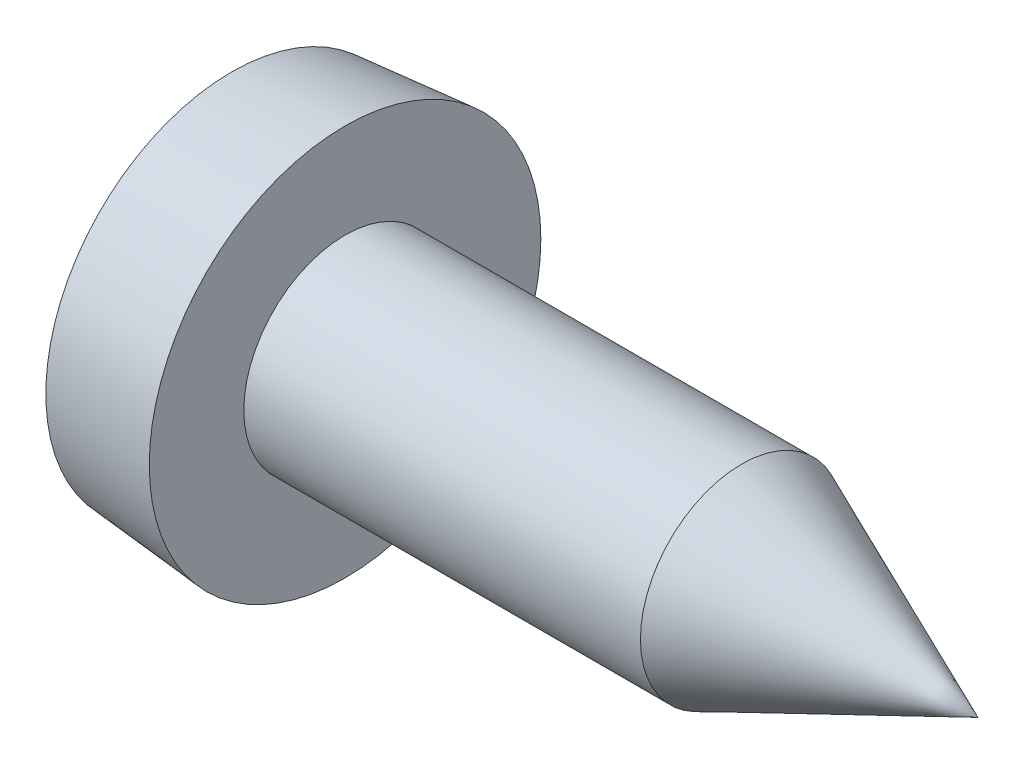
ISO-10303-21;
HEADER;
FILE_DESCRIPTION(('STEP AP214'),'2;1');
FILE_NAME('part.step','',(''),(''),'','','');
FILE_SCHEMA(('AUTOMOTIVE_DESIGN { 1 0 10303 214 1 1 1 1 }'));
ENDSEC;
DATA;
#1=APPLICATION_CONTEXT('core data for automotive mechanical design processes');
#2=APPLICATION_PROTOCOL_DEFINITION('international standard','automotive_design',2000,#1);
#3=PRODUCT_CONTEXT('',#1,'mechanical');
#4=PRODUCT('Part','Part','',(#3));
#5=PRODUCT_RELATED_PRODUCT_CATEGORY('part','',(#4));
#6=PRODUCT_DEFINITION_FORMATION('','',#4);
#7=PRODUCT_DEFINITION_CONTEXT('part definition',#1,'design');
#8=PRODUCT_DEFINITION('design','',#6,#7);
#9=PRODUCT_DEFINITION_SHAPE('','',#8);
#10=(LENGTH_UNIT() NAMED_UNIT(*) SI_UNIT(.MILLI.,.METRE.));
#11=(NAMED_UNIT(*) PLANE_ANGLE_UNIT() SI_UNIT($,.RADIAN.));
#12=(NAMED_UNIT(*) SI_UNIT($,.STERADIAN.) SOLID_ANGLE_UNIT());
#13=UNCERTAINTY_MEASURE_WITH_UNIT(LENGTH_MEASURE(1.E-05),#10,'distance_accuracy_value','');
#14=(GEOMETRIC_REPRESENTATION_CONTEXT(3) GLOBAL_UNCERTAINTY_ASSIGNED_CONTEXT((#13)) GLOBAL_UNIT_ASSIGNED_CONTEXT((#10,
#11,#12)) REPRESENTATION_CONTEXT('',''));
#15=CARTESIAN_POINT('',(0.,0.,0.));
#16=DIRECTION('',(0.,0.,1.));
#17=DIRECTION('',(1.,0.,0.));
#18=AXIS2_PLACEMENT_3D('',#15,#16,#17);
#19=CARTESIAN_POINT('',(-0.385297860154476,0.,0.));
#20=DIRECTION('',(-1.,0.,0.));
#21=DIRECTION('',(0.,0.,1.));
#22=AXIS2_PLACEMENT_3D('',#19,#20,#21);
#23=CONICAL_SURFACE('',#22,0.485787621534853,0.462512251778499);
#24=CARTESIAN_POINT('',(-0.385297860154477,0.,0.));
#25=DIRECTION('',(-1.,0.,0.));
#26=DIRECTION('',(0.,1.,0.));
#27=AXIS2_PLACEMENT_3D('',#24,#25,#26);
#28=CIRCLE('',#27,0.485787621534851);
#29=CARTESIAN_POINT('',(-0.385297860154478,-0.477080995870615,-0.0915605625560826));
#30=VERTEX_POINT('',#29);
#31=CARTESIAN_POINT('',(-0.385297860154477,-0.477080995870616,0.0915605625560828));
#32=VERTEX_POINT('',#31);
#33=EDGE_CURVE('E515',#30,#32,#28,.T.);
#34=ORIENTED_EDGE('',*,*,#33,.F.);
#35=CARTESIAN_POINT('',(-0.985192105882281,-0.770063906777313,-0.151803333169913));
#36=CARTESIAN_POINT('',(-0.885209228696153,-0.721234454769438,-0.141762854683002));
#37=CARTESIAN_POINT('',(-0.785226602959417,-0.672404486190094,-0.131722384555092));
#38=CARTESIAN_POINT('',(-0.585261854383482,-0.574743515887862,-0.111641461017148));
#39=CARTESIAN_POINT('',(-0.485279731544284,-0.525912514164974,-0.101601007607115));
#40=CARTESIAN_POINT('',(-0.385297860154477,-0.477080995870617,-0.0915605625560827));
#41=B_SPLINE_CURVE_WITH_KNOTS('',3,(#35,#36,#37,#38,#39,#40),.UNSPECIFIED.,.F.,.F.,(4,2,4),(0.,
0.33516461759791,0.670329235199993),.UNSPECIFIED.);
#42=CARTESIAN_POINT('',(-0.985192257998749,-0.77006398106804,-0.15180334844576));
#43=VERTEX_POINT('',#42);
#44=EDGE_CURVE('E405',#43,#30,#41,.T.);
#45=ORIENTED_EDGE('',*,*,#44,.F.);
#46=CARTESIAN_POINT('',(-0.985192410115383,0.,0.));
#47=DIRECTION('',(-1.,0.,0.));
#48=DIRECTION('',(0.,0.,-1.));
#49=AXIS2_PLACEMENT_3D('',#46,#47,#48);
#50=CIRCLE('',#49,0.78488401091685);
#51=CARTESIAN_POINT('',(-0.985192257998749,-0.77006398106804,0.15180334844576));
#52=VERTEX_POINT('',#51);
#53=EDGE_CURVE('E398',#52,#43,#50,.F.);
#54=ORIENTED_EDGE('',*,*,#53,.F.);
#55=CARTESIAN_POINT('',(-0.385297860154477,-0.477080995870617,0.0915605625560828));
#56=CARTESIAN_POINT('',(-0.485279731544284,-0.525912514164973,0.101601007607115));
#57=CARTESIAN_POINT('',(-0.585261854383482,-0.574743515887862,0.111641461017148));
#58=CARTESIAN_POINT('',(-0.785226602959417,-0.672404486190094,0.131722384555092));
#59=CARTESIAN_POINT('',(-0.885209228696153,-0.721234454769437,0.141762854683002));
#60=CARTESIAN_POINT('',(-0.985192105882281,-0.770063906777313,0.151803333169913));
#61=B_SPLINE_CURVE_WITH_KNOTS('',3,(#55,#56,#57,#58,#59,#60),.UNSPECIFIED.,.F.,.F.,(4,2,4),(0.,
0.335164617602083,0.670329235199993),.UNSPECIFIED.);
#62=EDGE_CURVE('E385',#32,#52,#61,.T.);
#63=ORIENTED_EDGE('',*,*,#62,.F.);
#64=EDGE_LOOP('',(#34,#45,#54,#63));
#65=FACE_BOUND('',#64,.T.);
#66=ADVANCED_FACE('F17',(#65),#23,.F.);
#67=CARTESIAN_POINT('',(-0.385297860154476,0.,0.));
#68=DIRECTION('',(-1.,0.,0.));
#69=DIRECTION('',(0.,0.,1.));
#70=AXIS2_PLACEMENT_3D('',#67,#68,#69);
#71=CONICAL_SURFACE('',#70,0.485787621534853,0.462512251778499);
#72=CARTESIAN_POINT('',(-0.385297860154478,0.,0.));
#73=DIRECTION('',(-1.,0.,0.));
#74=DIRECTION('',(0.,1.,0.));
#75=AXIS2_PLACEMENT_3D('',#72,#73,#74);
#76=CIRCLE('',#75,0.485787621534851);
#77=CARTESIAN_POINT('',(-0.385297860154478,0.0915605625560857,-0.477080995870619));
#78=VERTEX_POINT('',#77);
#79=CARTESIAN_POINT('',(-0.385297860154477,-0.0915605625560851,-0.477080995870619));
#80=VERTEX_POINT('',#79);
#81=EDGE_CURVE('E518',#78,#80,#76,.T.);
#82=ORIENTED_EDGE('',*,*,#81,.F.);
#83=CARTESIAN_POINT('',(-0.985192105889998,0.151803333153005,-0.770063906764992));
#84=CARTESIAN_POINT('',(-0.885209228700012,0.141762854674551,-0.721234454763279));
#85=CARTESIAN_POINT('',(-0.785226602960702,0.131722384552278,-0.672404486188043));
#86=CARTESIAN_POINT('',(-0.585261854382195,0.111641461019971,-0.57474351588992));
#87=CARTESIAN_POINT('',(-0.485279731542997,0.101601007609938,-0.525912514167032));
#88=CARTESIAN_POINT('',(-0.385297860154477,0.0915605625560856,-0.477080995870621));
#89=B_SPLINE_CURVE_WITH_KNOTS('',3,(#83,#84,#85,#86,#87,#88),.UNSPECIFIED.,.F.,.F.,(4,2,4),(0.,
0.33516461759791,0.670329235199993),.UNSPECIFIED.);
#90=CARTESIAN_POINT('',(-0.985192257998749,0.151803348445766,-0.770063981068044));
#91=VERTEX_POINT('',#90);
#92=EDGE_CURVE('E466',#91,#78,#89,.T.);
#93=ORIENTED_EDGE('',*,*,#92,.F.);
#94=CARTESIAN_POINT('',(-0.985192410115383,0.,0.));
#95=DIRECTION('',(-1.,0.,0.));
#96=DIRECTION('',(0.,0.,-1.));
#97=AXIS2_PLACEMENT_3D('',#94,#95,#96);
#98=CIRCLE('',#97,0.784884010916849);
#99=CARTESIAN_POINT('',(-0.985192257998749,-0.151803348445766,-0.770063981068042));
#100=VERTEX_POINT('',#99);
#101=EDGE_CURVE('E459',#100,#91,#98,.F.);
#102=ORIENTED_EDGE('',*,*,#101,.F.);
#103=CARTESIAN_POINT('',(-0.385297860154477,-0.0915605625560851,-0.47708099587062));
#104=CARTESIAN_POINT('',(-0.485279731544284,-0.101601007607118,-0.525912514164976));
#105=CARTESIAN_POINT('',(-0.585261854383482,-0.111641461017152,-0.574743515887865));
#106=CARTESIAN_POINT('',(-0.785226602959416,-0.131722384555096,-0.672404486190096));
#107=CARTESIAN_POINT('',(-0.885209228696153,-0.141762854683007,-0.72123445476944));
#108=CARTESIAN_POINT('',(-0.985192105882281,-0.151803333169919,-0.770063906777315));
#109=B_SPLINE_CURVE_WITH_KNOTS('',3,(#103,#104,#105,#106,#107,#108),.UNSPECIFIED.,.F.,.F.,(4,2,
4),(0.,0.335164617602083,0.670329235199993),.UNSPECIFIED.);
#110=EDGE_CURVE('E437',#80,#100,#109,.T.);
#111=ORIENTED_EDGE('',*,*,#110,.F.);
#112=EDGE_LOOP('',(#82,#93,#102,#111));
#113=FACE_BOUND('',#112,.T.);
#114=ADVANCED_FACE('F249',(#113),#71,.F.);
#115=CARTESIAN_POINT('',(-0.385297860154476,0.,0.));
#116=DIRECTION('',(-1.,0.,0.));
#117=DIRECTION('',(0.,0.,1.));
#118=AXIS2_PLACEMENT_3D('',#115,#116,#117);
#119=CONICAL_SURFACE('',#118,0.485787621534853,0.462512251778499);
#120=CARTESIAN_POINT('',(-0.385297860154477,0.,0.));
#121=DIRECTION('',(-1.,0.,0.));
#122=DIRECTION('',(0.,1.,0.));
#123=AXIS2_PLACEMENT_3D('',#120,#121,#122);
#124=CIRCLE('',#123,0.485787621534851);
#125=CARTESIAN_POINT('',(-0.385297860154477,0.477080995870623,0.091560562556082));
#126=VERTEX_POINT('',#125);
#127=CARTESIAN_POINT('',(-0.385297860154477,0.477080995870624,-0.0915605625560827));
#128=VERTEX_POINT('',#127);
#129=EDGE_CURVE('E516',#126,#128,#124,.T.);
#130=ORIENTED_EDGE('',*,*,#129,.F.);
#131=CARTESIAN_POINT('',(-0.985192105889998,0.770063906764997,0.151803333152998));
#132=CARTESIAN_POINT('',(-0.885209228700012,0.721234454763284,0.141762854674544));
#133=CARTESIAN_POINT('',(-0.785226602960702,0.672404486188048,0.131722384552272));
#134=CARTESIAN_POINT('',(-0.585261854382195,0.574743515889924,0.111641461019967));
#135=CARTESIAN_POINT('',(-0.485279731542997,0.525912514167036,0.101601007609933));
#136=CARTESIAN_POINT('',(-0.385297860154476,0.477080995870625,0.0915605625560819));
#137=B_SPLINE_CURVE_WITH_KNOTS('',3,(#131,#132,#133,#134,#135,#136),.UNSPECIFIED.,.F.,.F.,(4,2,
4),(0.,0.33516461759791,0.670329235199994),.UNSPECIFIED.);
#138=CARTESIAN_POINT('',(-0.985192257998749,0.770063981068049,0.151803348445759));
#139=VERTEX_POINT('',#138);
#140=EDGE_CURVE('E254',#139,#126,#137,.T.);
#141=ORIENTED_EDGE('',*,*,#140,.F.);
#142=CARTESIAN_POINT('',(-0.985192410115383,0.,0.));
#143=DIRECTION('',(-1.,0.,0.));
#144=DIRECTION('',(0.,0.,-1.));
#145=AXIS2_PLACEMENT_3D('',#142,#143,#144);
#146=CIRCLE('',#145,0.784884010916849);
#147=CARTESIAN_POINT('',(-0.985192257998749,0.770063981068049,-0.15180334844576));
#148=VERTEX_POINT('',#147);
#149=EDGE_CURVE('E204',#148,#139,#146,.F.);
#150=ORIENTED_EDGE('',*,*,#149,.F.);
#151=CARTESIAN_POINT('',(-0.385297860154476,0.477080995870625,-0.0915605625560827));
#152=CARTESIAN_POINT('',(-0.485279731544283,0.525912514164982,-0.101601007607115));
#153=CARTESIAN_POINT('',(-0.585261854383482,0.57474351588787,-0.111641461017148));
#154=CARTESIAN_POINT('',(-0.785226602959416,0.672404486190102,-0.131722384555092));
#155=CARTESIAN_POINT('',(-0.885209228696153,0.721234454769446,-0.141762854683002));
#156=CARTESIAN_POINT('',(-0.985192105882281,0.770063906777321,-0.151803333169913));
#157=B_SPLINE_CURVE_WITH_KNOTS('',3,(#151,#152,#153,#154,#155,#156),.UNSPECIFIED.,.F.,.F.,(4,2,
4),(0.,0.335164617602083,0.670329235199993),.UNSPECIFIED.);
#158=EDGE_CURVE('E233',#128,#148,#157,.T.);
#159=ORIENTED_EDGE('',*,*,#158,.F.);
#160=EDGE_LOOP('',(#130,#141,#150,#159));
#161=FACE_BOUND('',#160,.T.);
#162=ADVANCED_FACE('F245',(#161),#119,.F.);
#163=CARTESIAN_POINT('',(-0.126999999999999,0.,0.));
#164=DIRECTION('',(-1.,0.,0.));
#165=DIRECTION('',(0.,0.,1.));
#166=AXIS2_PLACEMENT_3D('',#163,#164,#165);
#167=CONICAL_SURFACE('',#166,0.,1.08210413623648);
#168=CARTESIAN_POINT('',(-0.126999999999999,0.,0.));
#169=VERTEX_POINT('',#168);
#170=VERTEX_LOOP('',#169);
#171=FACE_BOUND('',#170,.T.);
#172=CARTESIAN_POINT('',(-0.270652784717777,0.0757739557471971,0.259327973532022));
#173=CARTESIAN_POINT('',(-0.280133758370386,0.0770841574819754,0.277512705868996));
#174=CARTESIAN_POINT('',(-0.289642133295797,0.0783963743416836,0.295682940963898));
#175=CARTESIAN_POINT('',(-0.308699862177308,0.0810238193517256,0.332001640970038));
#176=CARTESIAN_POINT('',(-0.318249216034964,0.0823390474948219,0.350150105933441));
#177=CARTESIAN_POINT('',(-0.346938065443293,0.086287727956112,0.404573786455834));
#178=CARTESIAN_POINT('',(-0.366118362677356,0.0889241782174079,0.440827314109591));
#179=CARTESIAN_POINT('',(-0.385297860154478,0.0915605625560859,0.47708099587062));
#180=B_SPLINE_CURVE_WITH_KNOTS('',3,(#172,#173,#174,#175,#176,#177,#178,#179),.UNSPECIFIED.,.F.,
.F.,(4,2,2,4),(0.,0.0616489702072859,0.123297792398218,0.246595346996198),.UNSPECIFIED.);
#181=CARTESIAN_POINT('',(-0.270652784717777,0.0757739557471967,0.259327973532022));
#182=VERTEX_POINT('',#181);
#183=CARTESIAN_POINT('',(-0.385297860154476,0.0915605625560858,0.477080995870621));
#184=VERTEX_POINT('',#183);
#185=EDGE_CURVE('E196',#182,#184,#180,.T.);
#186=ORIENTED_EDGE('',*,*,#185,.F.);
#187=CARTESIAN_POINT('',(-0.270652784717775,0.259327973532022,0.0757739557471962));
#188=CARTESIAN_POINT('',(-0.265106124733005,0.248614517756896,0.0750098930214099));
#189=CARTESIAN_POINT('',(-0.259579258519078,0.237758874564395,0.0752023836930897));
#190=CARTESIAN_POINT('',(-0.248964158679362,0.215907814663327,0.0776566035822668));
#191=CARTESIAN_POINT('',(-0.24388214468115,0.204912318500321,0.0799437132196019));
#192=CARTESIAN_POINT('',(-0.23627651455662,0.186900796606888,0.0856067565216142));
#193=CARTESIAN_POINT('',(-0.233471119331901,0.179805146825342,0.0883463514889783));
#194=CARTESIAN_POINT('',(-0.228547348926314,0.165875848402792,0.0948538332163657));
#195=CARTESIAN_POINT('',(-0.226426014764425,0.159041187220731,0.0986171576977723));
#196=CARTESIAN_POINT('',(-0.223409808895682,0.146878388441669,0.106491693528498));
#197=CARTESIAN_POINT('',(-0.222371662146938,0.141485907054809,0.110447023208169));
#198=CARTESIAN_POINT('',(-0.221112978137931,0.131162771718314,0.119033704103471));
#199=CARTESIAN_POINT('',(-0.220891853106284,0.12623178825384,0.123664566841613));
#200=CARTESIAN_POINT('',(-0.221302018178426,0.116988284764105,0.133470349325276));
#201=CARTESIAN_POINT('',(-0.22193320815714,0.112675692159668,0.138645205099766));
#202=CARTESIAN_POINT('',(-0.223950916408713,0.104760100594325,0.149377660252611));
#203=CARTESIAN_POINT('',(-0.225338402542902,0.10115801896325,0.154935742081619));
#204=CARTESIAN_POINT('',(-0.22927913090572,0.0935800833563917,0.168238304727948));
#205=CARTESIAN_POINT('',(-0.232068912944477,0.0898990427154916,0.176079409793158));
#206=CARTESIAN_POINT('',(-0.238335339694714,0.0837976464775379,0.191991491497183));
#207=CARTESIAN_POINT('',(-0.241814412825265,0.0813818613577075,0.200063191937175));
#208=CARTESIAN_POINT('',(-0.249384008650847,0.0776447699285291,0.216734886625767));
#209=CARTESIAN_POINT('',(-0.253497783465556,0.0763918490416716,0.225339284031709));
#210=CARTESIAN_POINT('',(-0.261948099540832,0.0751611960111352,0.242430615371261));
#211=CARTESIAN_POINT('',(-0.266282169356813,0.0751715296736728,0.250917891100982));
#212=CARTESIAN_POINT('',(-0.270652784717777,0.0757739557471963,0.259327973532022));
#213=B_SPLINE_CURVE_WITH_KNOTS('',3,(#187,#188,#189,#190,#191,#192,#193,#194,#195,#196,#197,
#198,#199,#200,#201,#202,#203,#204,#205,#206,#207,#208,#209,#210,#211,#212),.UNSPECIFIED.,.F.,
.F.,(4,2,2,2,2,2,2,2,2,2,2,2,4),(0.,0.0363217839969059,0.0730895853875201,0.0973320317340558,
0.121468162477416,0.141682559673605,0.161882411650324,0.18207989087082,0.202303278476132,
0.229455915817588,0.25670597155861,0.285472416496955,0.313967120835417),.UNSPECIFIED.);
#214=CARTESIAN_POINT('',(-0.270652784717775,0.259327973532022,0.0757739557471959));
#215=VERTEX_POINT('',#214);
#216=EDGE_CURVE('E197',#215,#182,#213,.T.);
#217=ORIENTED_EDGE('',*,*,#216,.F.);
#218=CARTESIAN_POINT('',(-0.385297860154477,0.477080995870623,0.0915605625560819));
#219=CARTESIAN_POINT('',(-0.366118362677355,0.440827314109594,0.0889241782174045));
#220=CARTESIAN_POINT('',(-0.346938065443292,0.404573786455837,0.0862877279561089));
#221=CARTESIAN_POINT('',(-0.318249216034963,0.350150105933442,0.0823390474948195));
#222=CARTESIAN_POINT('',(-0.308699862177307,0.332001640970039,0.0810238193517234));
#223=CARTESIAN_POINT('',(-0.289642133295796,0.295682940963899,0.0783963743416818));
#224=CARTESIAN_POINT('',(-0.280133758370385,0.277512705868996,0.0770841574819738));
#225=CARTESIAN_POINT('',(-0.270652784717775,0.259327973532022,0.0757739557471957));
#226=B_SPLINE_CURVE_WITH_KNOTS('',3,(#218,#219,#220,#221,#222,#223,#224,#225),.UNSPECIFIED.,.F.,
.F.,(4,2,2,4),(0.,0.123297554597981,0.184946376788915,0.246595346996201),.UNSPECIFIED.);
#227=EDGE_CURVE('E201',#126,#215,#226,.T.);
#228=ORIENTED_EDGE('',*,*,#227,.F.);
#229=ORIENTED_EDGE('',*,*,#129,.T.);
#230=CARTESIAN_POINT('',(-0.270652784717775,0.259327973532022,-0.0757739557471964));
#231=CARTESIAN_POINT('',(-0.280133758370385,0.277512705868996,-0.0770841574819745));
#232=CARTESIAN_POINT('',(-0.289642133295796,0.295682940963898,-0.0783963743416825));
#233=CARTESIAN_POINT('',(-0.308699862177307,0.332001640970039,-0.0810238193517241));
#234=CARTESIAN_POINT('',(-0.318249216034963,0.350150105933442,-0.0823390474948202));
#235=CARTESIAN_POINT('',(-0.346938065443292,0.404573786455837,-0.0862877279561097));
#236=CARTESIAN_POINT('',(-0.366118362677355,0.440827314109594,-0.0889241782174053));
#237=CARTESIAN_POINT('',(-0.385297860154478,0.477080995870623,-0.0915605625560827));
#238=B_SPLINE_CURVE_WITH_KNOTS('',3,(#230,#231,#232,#233,#234,#235,#236,#237),.UNSPECIFIED.,.F.,
.F.,(4,2,2,4),(0.,0.0616489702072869,0.12329779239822,0.246595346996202),.UNSPECIFIED.);
#239=CARTESIAN_POINT('',(-0.270652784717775,0.259327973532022,-0.0757739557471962));
#240=VERTEX_POINT('',#239);
#241=EDGE_CURVE('E239',#240,#128,#238,.T.);
#242=ORIENTED_EDGE('',*,*,#241,.F.);
#243=CARTESIAN_POINT('',(-0.270652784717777,0.0757739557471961,-0.259327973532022));
#244=CARTESIAN_POINT('',(-0.265106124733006,0.0750098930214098,-0.248614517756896));
#245=CARTESIAN_POINT('',(-0.259579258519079,0.0752023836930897,-0.237758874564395));
#246=CARTESIAN_POINT('',(-0.248964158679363,0.0776566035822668,-0.215907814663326));
#247=CARTESIAN_POINT('',(-0.243882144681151,0.0799437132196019,-0.204912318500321));
#248=CARTESIAN_POINT('',(-0.236276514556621,0.0856067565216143,-0.186900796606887));
#249=CARTESIAN_POINT('',(-0.233471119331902,0.0883463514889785,-0.179805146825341));
#250=CARTESIAN_POINT('',(-0.228547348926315,0.094853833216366,-0.165875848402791));
#251=CARTESIAN_POINT('',(-0.226426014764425,0.0986171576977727,-0.15904118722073));
#252=CARTESIAN_POINT('',(-0.223409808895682,0.106491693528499,-0.146878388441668));
#253=CARTESIAN_POINT('',(-0.222371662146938,0.110447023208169,-0.141485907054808));
#254=CARTESIAN_POINT('',(-0.221112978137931,0.119033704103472,-0.131162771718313));
#255=CARTESIAN_POINT('',(-0.220891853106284,0.123664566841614,-0.126231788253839));
#256=CARTESIAN_POINT('',(-0.221302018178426,0.133470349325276,-0.116988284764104));
#257=CARTESIAN_POINT('',(-0.22193320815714,0.138645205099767,-0.112675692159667));
#258=CARTESIAN_POINT('',(-0.223950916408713,0.149377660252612,-0.104760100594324));
#259=CARTESIAN_POINT('',(-0.225338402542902,0.154935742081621,-0.101158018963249));
#260=CARTESIAN_POINT('',(-0.22927913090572,0.168238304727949,-0.0935800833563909));
#261=CARTESIAN_POINT('',(-0.232068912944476,0.176079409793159,-0.0898990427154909));
#262=CARTESIAN_POINT('',(-0.238335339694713,0.191991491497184,-0.0837976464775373));
#263=CARTESIAN_POINT('',(-0.241814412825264,0.200063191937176,-0.081381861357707));
#264=CARTESIAN_POINT('',(-0.249384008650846,0.216734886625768,-0.0776447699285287));
#265=CARTESIAN_POINT('',(-0.253497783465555,0.225339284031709,-0.0763918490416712));
#266=CARTESIAN_POINT('',(-0.261948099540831,0.242430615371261,-0.0751611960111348));
#267=CARTESIAN_POINT('',(-0.266282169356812,0.250917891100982,-0.0751715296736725));
#268=CARTESIAN_POINT('',(-0.270652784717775,0.259327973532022,-0.0757739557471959));
#269=B_SPLINE_CURVE_WITH_KNOTS('',3,(#243,#244,#245,#246,#247,#248,#249,#250,#251,#252,#253,
#254,#255,#256,#257,#258,#259,#260,#261,#262,#263,#264,#265,#266,#267,#268),.UNSPECIFIED.,.F.,
.F.,(4,2,2,2,2,2,2,2,2,2,2,2,4),(0.,0.0363217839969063,0.0730895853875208,0.0973320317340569,
0.121468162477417,0.141682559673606,0.161882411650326,0.182079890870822,0.202303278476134,
0.22945591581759,0.256705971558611,0.285472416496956,0.313967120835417),.UNSPECIFIED.);
#270=CARTESIAN_POINT('',(-0.270652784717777,0.0757739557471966,-0.259327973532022));
#271=VERTEX_POINT('',#270);
#272=EDGE_CURVE('E485',#271,#240,#269,.T.);
#273=ORIENTED_EDGE('',*,*,#272,.F.);
#274=CARTESIAN_POINT('',(-0.385297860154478,0.0915605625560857,-0.47708099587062));
#275=CARTESIAN_POINT('',(-0.366118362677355,0.0889241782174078,-0.440827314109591));
#276=CARTESIAN_POINT('',(-0.346938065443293,0.0862877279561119,-0.404573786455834));
#277=CARTESIAN_POINT('',(-0.318249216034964,0.0823390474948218,-0.350150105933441));
#278=CARTESIAN_POINT('',(-0.308699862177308,0.0810238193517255,-0.332001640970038));
#279=CARTESIAN_POINT('',(-0.289642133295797,0.0783963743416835,-0.295682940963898));
#280=CARTESIAN_POINT('',(-0.280133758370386,0.0770841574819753,-0.277512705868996));
#281=CARTESIAN_POINT('',(-0.270652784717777,0.075773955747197,-0.259327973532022));
#282=B_SPLINE_CURVE_WITH_KNOTS('',3,(#274,#275,#276,#277,#278,#279,#280,#281),.UNSPECIFIED.,.F.,
.F.,(4,2,2,4),(0.,0.12329755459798,0.184946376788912,0.246595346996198),.UNSPECIFIED.);
#283=EDGE_CURVE('E479',#78,#271,#282,.T.);
#284=ORIENTED_EDGE('',*,*,#283,.F.);
#285=ORIENTED_EDGE('',*,*,#81,.T.);
#286=CARTESIAN_POINT('',(-0.270652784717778,-0.0757739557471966,-0.259327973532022));
#287=CARTESIAN_POINT('',(-0.280133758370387,-0.0770841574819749,-0.277512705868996));
#288=CARTESIAN_POINT('',(-0.289642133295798,-0.0783963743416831,-0.295682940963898));
#289=CARTESIAN_POINT('',(-0.308699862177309,-0.0810238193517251,-0.332001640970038));
#290=CARTESIAN_POINT('',(-0.318249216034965,-0.0823390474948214,-0.35015010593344));
#291=CARTESIAN_POINT('',(-0.346938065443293,-0.0862877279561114,-0.404573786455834));
#292=CARTESIAN_POINT('',(-0.366118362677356,-0.0889241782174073,-0.44082731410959));
#293=CARTESIAN_POINT('',(-0.385297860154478,-0.0915605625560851,-0.477080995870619));
#294=B_SPLINE_CURVE_WITH_KNOTS('',3,(#286,#287,#288,#289,#290,#291,#292,#293),.UNSPECIFIED.,.F.,
.F.,(4,2,2,4),(0.,0.0616489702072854,0.123297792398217,0.246595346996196),.UNSPECIFIED.);
#295=CARTESIAN_POINT('',(-0.270652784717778,-0.0757739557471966,-0.259327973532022));
#296=VERTEX_POINT('',#295);
#297=EDGE_CURVE('E431',#296,#80,#294,.T.);
#298=ORIENTED_EDGE('',*,*,#297,.F.);
#299=CARTESIAN_POINT('',(-0.27065278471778,-0.259327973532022,-0.0757739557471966));
#300=CARTESIAN_POINT('',(-0.265106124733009,-0.248614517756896,-0.0750098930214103));
#301=CARTESIAN_POINT('',(-0.259579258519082,-0.237758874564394,-0.0752023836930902));
#302=CARTESIAN_POINT('',(-0.248964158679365,-0.215907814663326,-0.0776566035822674));
#303=CARTESIAN_POINT('',(-0.243882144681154,-0.20491231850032,-0.0799437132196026));
#304=CARTESIAN_POINT('',(-0.236276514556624,-0.186900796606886,-0.0856067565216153));
#305=CARTESIAN_POINT('',(-0.233471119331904,-0.17980514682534,-0.0883463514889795));
#306=CARTESIAN_POINT('',(-0.228547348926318,-0.16587584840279,-0.0948538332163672));
#307=CARTESIAN_POINT('',(-0.226426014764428,-0.159041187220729,-0.0986171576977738));
#308=CARTESIAN_POINT('',(-0.223409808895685,-0.146878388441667,-0.1064916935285));
#309=CARTESIAN_POINT('',(-0.222371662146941,-0.141485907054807,-0.110447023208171));
#310=CARTESIAN_POINT('',(-0.221112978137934,-0.131162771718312,-0.119033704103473));
#311=CARTESIAN_POINT('',(-0.220891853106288,-0.126231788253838,-0.123664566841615));
#312=CARTESIAN_POINT('',(-0.221302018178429,-0.116988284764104,-0.133470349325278));
#313=CARTESIAN_POINT('',(-0.221933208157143,-0.112675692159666,-0.138645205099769));
#314=CARTESIAN_POINT('',(-0.223950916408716,-0.104760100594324,-0.149377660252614));
#315=CARTESIAN_POINT('',(-0.225338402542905,-0.101158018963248,-0.154935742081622));
#316=CARTESIAN_POINT('',(-0.229279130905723,-0.0935800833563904,-0.168238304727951));
#317=CARTESIAN_POINT('',(-0.23206891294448,-0.0898990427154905,-0.176079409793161));
#318=CARTESIAN_POINT('',(-0.238335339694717,-0.0837976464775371,-0.191991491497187));
#319=CARTESIAN_POINT('',(-0.241814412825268,-0.0813818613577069,-0.200063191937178));
#320=CARTESIAN_POINT('',(-0.249384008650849,-0.0776447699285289,-0.21673488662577));
#321=CARTESIAN_POINT('',(-0.253497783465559,-0.0763918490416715,-0.225339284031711));
#322=CARTESIAN_POINT('',(-0.261948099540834,-0.0751611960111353,-0.242430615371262));
#323=CARTESIAN_POINT('',(-0.266282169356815,-0.075171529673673,-0.250917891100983));
#324=CARTESIAN_POINT('',(-0.270652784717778,-0.0757739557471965,-0.259327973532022));
#325=B_SPLINE_CURVE_WITH_KNOTS('',3,(#299,#300,#301,#302,#303,#304,#305,#306,#307,#308,#309,
#310,#311,#312,#313,#314,#315,#316,#317,#318,#319,#320,#321,#322,#323,#324),.UNSPECIFIED.,.F.,
.F.,(4,2,2,2,2,2,2,2,2,2,2,2,4),(0.,0.0363217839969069,0.0730895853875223,0.097332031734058,
0.121468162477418,0.141682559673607,0.161882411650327,0.182079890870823,0.202303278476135,
0.229455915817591,0.256705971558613,0.285472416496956,0.313967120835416),.UNSPECIFIED.);
#326=CARTESIAN_POINT('',(-0.27065278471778,-0.259327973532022,-0.0757739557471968));
#327=VERTEX_POINT('',#326);
#328=EDGE_CURVE('E425',#327,#296,#325,.T.);
#329=ORIENTED_EDGE('',*,*,#328,.F.);
#330=CARTESIAN_POINT('',(-0.385297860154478,-0.477080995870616,-0.0915605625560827));
#331=CARTESIAN_POINT('',(-0.366118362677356,-0.440827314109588,-0.0889241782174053));
#332=CARTESIAN_POINT('',(-0.346938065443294,-0.404573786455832,-0.0862877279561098));
#333=CARTESIAN_POINT('',(-0.318249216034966,-0.350150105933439,-0.0823390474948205));
#334=CARTESIAN_POINT('',(-0.30869986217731,-0.332001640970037,-0.0810238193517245));
#335=CARTESIAN_POINT('',(-0.289642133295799,-0.295682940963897,-0.0783963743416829));
#336=CARTESIAN_POINT('',(-0.280133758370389,-0.277512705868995,-0.077084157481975));
#337=CARTESIAN_POINT('',(-0.27065278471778,-0.259327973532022,-0.0757739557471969));
#338=B_SPLINE_CURVE_WITH_KNOTS('',3,(#330,#331,#332,#333,#334,#335,#336,#337),.UNSPECIFIED.,.F.,
.F.,(4,2,2,4),(0.,0.123297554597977,0.184946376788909,0.246595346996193),.UNSPECIFIED.);
#339=EDGE_CURVE('E418',#30,#327,#338,.T.);
#340=ORIENTED_EDGE('',*,*,#339,.F.);
#341=ORIENTED_EDGE('',*,*,#33,.T.);
#342=CARTESIAN_POINT('',(-0.27065278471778,-0.259327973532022,0.075773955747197));
#343=CARTESIAN_POINT('',(-0.280133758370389,-0.277512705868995,0.0770841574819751));
#344=CARTESIAN_POINT('',(-0.289642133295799,-0.295682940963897,0.0783963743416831));
#345=CARTESIAN_POINT('',(-0.30869986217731,-0.332001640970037,0.0810238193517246));
#346=CARTESIAN_POINT('',(-0.318249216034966,-0.350150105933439,0.0823390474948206));
#347=CARTESIAN_POINT('',(-0.346938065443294,-0.404573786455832,0.0862877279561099));
#348=CARTESIAN_POINT('',(-0.366118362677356,-0.440827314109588,0.0889241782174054));
#349=CARTESIAN_POINT('',(-0.385297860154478,-0.477080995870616,0.0915605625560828));
#350=B_SPLINE_CURVE_WITH_KNOTS('',3,(#342,#343,#344,#345,#346,#347,#348,#349),.UNSPECIFIED.,.F.,
.F.,(4,2,2,4),(0.,0.0616489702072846,0.123297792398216,0.246595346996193),.UNSPECIFIED.);
#351=CARTESIAN_POINT('',(-0.27065278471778,-0.259327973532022,0.0757739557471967));
#352=VERTEX_POINT('',#351);
#353=EDGE_CURVE('E509',#352,#32,#350,.T.);
#354=ORIENTED_EDGE('',*,*,#353,.F.);
#355=CARTESIAN_POINT('',(-0.270652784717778,-0.0757739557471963,0.259327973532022));
#356=CARTESIAN_POINT('',(-0.265106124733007,-0.0750098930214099,0.248614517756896));
#357=CARTESIAN_POINT('',(-0.25957925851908,-0.0752023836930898,0.237758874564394));
#358=CARTESIAN_POINT('',(-0.248964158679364,-0.077656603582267,0.215907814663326));
#359=CARTESIAN_POINT('',(-0.243882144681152,-0.0799437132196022,0.20491231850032));
#360=CARTESIAN_POINT('',(-0.236276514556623,-0.0856067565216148,0.186900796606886));
#361=CARTESIAN_POINT('',(-0.233471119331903,-0.0883463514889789,0.17980514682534));
#362=CARTESIAN_POINT('',(-0.228547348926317,-0.0948538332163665,0.165875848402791));
#363=CARTESIAN_POINT('',(-0.226426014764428,-0.098617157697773,0.15904118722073));
#364=CARTESIAN_POINT('',(-0.223409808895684,-0.106491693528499,0.146878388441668));
#365=CARTESIAN_POINT('',(-0.22237166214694,-0.11044702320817,0.141485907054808));
#366=CARTESIAN_POINT('',(-0.221112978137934,-0.119033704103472,0.131162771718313));
#367=CARTESIAN_POINT('',(-0.220891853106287,-0.123664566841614,0.126231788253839));
#368=CARTESIAN_POINT('',(-0.221302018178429,-0.133470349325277,0.116988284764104));
#369=CARTESIAN_POINT('',(-0.221933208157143,-0.138645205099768,0.112675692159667));
#370=CARTESIAN_POINT('',(-0.223950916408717,-0.149377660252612,0.104760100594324));
#371=CARTESIAN_POINT('',(-0.225338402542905,-0.154935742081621,0.101158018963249));
#372=CARTESIAN_POINT('',(-0.229279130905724,-0.16823830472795,0.0935800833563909));
#373=CARTESIAN_POINT('',(-0.232068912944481,-0.17607940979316,0.0898990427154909));
#374=CARTESIAN_POINT('',(-0.238335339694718,-0.191991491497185,0.0837976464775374));
#375=CARTESIAN_POINT('',(-0.241814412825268,-0.200063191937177,0.081381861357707));
#376=CARTESIAN_POINT('',(-0.24938400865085,-0.216734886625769,0.0776447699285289));
#377=CARTESIAN_POINT('',(-0.25349778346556,-0.225339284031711,0.0763918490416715));
#378=CARTESIAN_POINT('',(-0.261948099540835,-0.242430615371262,0.0751611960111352));
#379=CARTESIAN_POINT('',(-0.266282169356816,-0.250917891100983,0.0751715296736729));
#380=CARTESIAN_POINT('',(-0.27065278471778,-0.259327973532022,0.0757739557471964));
#381=B_SPLINE_CURVE_WITH_KNOTS('',3,(#355,#356,#357,#358,#359,#360,#361,#362,#363,#364,#365,
#366,#367,#368,#369,#370,#371,#372,#373,#374,#375,#376,#377,#378,#379,#380),.UNSPECIFIED.,.F.,
.F.,(4,2,2,2,2,2,2,2,2,2,2,2,4),(0.,0.0363217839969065,0.0730895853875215,0.097332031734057,
0.121468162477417,0.141682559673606,0.161882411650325,0.182079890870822,0.202303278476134,
0.22945591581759,0.256705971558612,0.285472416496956,0.313967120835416),.UNSPECIFIED.);
#382=CARTESIAN_POINT('',(-0.270652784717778,-0.0757739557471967,0.259327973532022));
#383=VERTEX_POINT('',#382);
#384=EDGE_CURVE('E510',#383,#352,#381,.T.);
#385=ORIENTED_EDGE('',*,*,#384,.F.);
#386=CARTESIAN_POINT('',(-0.385297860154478,-0.0915605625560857,0.477080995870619));
#387=CARTESIAN_POINT('',(-0.366118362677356,-0.0889241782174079,0.440827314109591));
#388=CARTESIAN_POINT('',(-0.346938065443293,-0.0862877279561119,0.404573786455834));
#389=CARTESIAN_POINT('',(-0.318249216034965,-0.0823390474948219,0.350150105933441));
#390=CARTESIAN_POINT('',(-0.308699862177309,-0.0810238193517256,0.332001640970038));
#391=CARTESIAN_POINT('',(-0.289642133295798,-0.0783963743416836,0.295682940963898));
#392=CARTESIAN_POINT('',(-0.280133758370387,-0.0770841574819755,0.277512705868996));
#393=CARTESIAN_POINT('',(-0.270652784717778,-0.0757739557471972,0.259327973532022));
#394=B_SPLINE_CURVE_WITH_KNOTS('',3,(#386,#387,#388,#389,#390,#391,#392,#393),.UNSPECIFIED.,.F.,
.F.,(4,2,2,4),(0.,0.123297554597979,0.184946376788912,0.246595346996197),.UNSPECIFIED.);
#395=CARTESIAN_POINT('',(-0.385297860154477,-0.0915605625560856,0.477080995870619));
#396=VERTEX_POINT('',#395);
#397=EDGE_CURVE('E174',#396,#383,#394,.T.);
#398=ORIENTED_EDGE('',*,*,#397,.F.);
#399=CARTESIAN_POINT('',(-0.385297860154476,0.,0.));
#400=DIRECTION('',(-1.,0.,0.));
#401=DIRECTION('',(0.,1.,0.));
#402=AXIS2_PLACEMENT_3D('',#399,#400,#401);
#403=CIRCLE('',#402,0.485787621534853);
#404=EDGE_CURVE('E171',#184,#396,#403,.F.);
#405=ORIENTED_EDGE('',*,*,#404,.F.);
#406=EDGE_LOOP('',(#186,#217,#228,#229,#242,#273,#284,#285,#298,#329,#340,#341,#354,#385,#398,#405));
#407=FACE_BOUND('',#406,.T.);
#408=ADVANCED_FACE('F248',(#171,#407),#167,.F.);
#409=CARTESIAN_POINT('',(-0.385297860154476,0.,0.));
#410=DIRECTION('',(-1.,0.,0.));
#411=DIRECTION('',(0.,0.,1.));
#412=AXIS2_PLACEMENT_3D('',#409,#410,#411);
#413=CONICAL_SURFACE('',#412,0.485787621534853,0.462512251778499);
#414=ORIENTED_EDGE('',*,*,#404,.T.);
#415=CARTESIAN_POINT('',(-0.985192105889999,-0.151803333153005,0.770063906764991));
#416=CARTESIAN_POINT('',(-0.885209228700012,-0.141762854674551,0.721234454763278));
#417=CARTESIAN_POINT('',(-0.785226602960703,-0.131722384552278,0.672404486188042));
#418=CARTESIAN_POINT('',(-0.585261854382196,-0.111641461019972,0.574743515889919));
#419=CARTESIAN_POINT('',(-0.485279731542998,-0.101601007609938,0.52591251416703));
#420=CARTESIAN_POINT('',(-0.385297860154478,-0.0915605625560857,0.47708099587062));
#421=B_SPLINE_CURVE_WITH_KNOTS('',3,(#415,#416,#417,#418,#419,#420),.UNSPECIFIED.,.F.,.F.,(4,2,
4),(0.,0.33516461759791,0.670329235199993),.UNSPECIFIED.);
#422=CARTESIAN_POINT('',(-0.985192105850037,-0.151803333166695,0.770063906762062));
#423=VERTEX_POINT('',#422);
#424=EDGE_CURVE('E21',#423,#396,#421,.T.);
#425=ORIENTED_EDGE('',*,*,#424,.F.);
#426=CARTESIAN_POINT('',(-0.985192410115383,0.,0.));
#427=DIRECTION('',(-1.,0.,0.));
#428=DIRECTION('',(0.,0.,-1.));
#429=AXIS2_PLACEMENT_3D('',#426,#427,#428);
#430=CIRCLE('',#429,0.784884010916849);
#431=CARTESIAN_POINT('',(-0.985192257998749,0.151803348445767,0.770063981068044));
#432=VERTEX_POINT('',#431);
#433=EDGE_CURVE('E169',#432,#423,#430,.F.);
#434=ORIENTED_EDGE('',*,*,#433,.F.);
#435=CARTESIAN_POINT('',(-0.385297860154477,0.0915605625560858,0.477080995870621));
#436=CARTESIAN_POINT('',(-0.485279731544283,0.101601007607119,0.525912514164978));
#437=CARTESIAN_POINT('',(-0.585261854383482,0.111641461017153,0.574743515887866));
#438=CARTESIAN_POINT('',(-0.785226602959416,0.131722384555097,0.672404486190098));
#439=CARTESIAN_POINT('',(-0.885209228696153,0.141762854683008,0.721234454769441));
#440=CARTESIAN_POINT('',(-0.985192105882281,0.15180333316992,0.770063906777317));
#441=B_SPLINE_CURVE_WITH_KNOTS('',3,(#435,#436,#437,#438,#439,#440),.UNSPECIFIED.,.F.,.F.,(4,2,
4),(0.,0.335164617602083,0.670329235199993),.UNSPECIFIED.);
#442=EDGE_CURVE('E187',#184,#432,#441,.T.);
#443=ORIENTED_EDGE('',*,*,#442,.F.);
#444=EDGE_LOOP('',(#414,#425,#434,#443));
#445=FACE_BOUND('',#444,.T.);
#446=ADVANCED_FACE('F166',(#445),#413,.F.);
#447=CARTESIAN_POINT('',(-1.14781180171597,-0.151713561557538,0.22796337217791));
#448=DIRECTION('',(-0.0871557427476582,0.995847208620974,0.0263099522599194));
#449=DIRECTION('',(-0.996192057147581,-0.0871859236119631,0.));
#450=AXIS2_PLACEMENT_3D('',#447,#448,#449);
#451=PLANE('',#450);
#452=ORIENTED_EDGE('',*,*,#397,.T.);
#453=DIRECTION('',(0.996194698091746,0.087125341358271,0.00230182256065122));
#454=VECTOR('',#453,1.);
#455=CARTESIAN_POINT('',(-1.21584937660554,-0.158439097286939,0.257143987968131));
#456=LINE('',#455,#454);
#457=CARTESIAN_POINT('',(-1.10604232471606,-0.148835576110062,0.257397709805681));
#458=VERTEX_POINT('',#457);
#459=EDGE_CURVE('E511',#458,#383,#456,.T.);
#460=ORIENTED_EDGE('',*,*,#459,.F.);
#461=CARTESIAN_POINT('',(-1.02008416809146,-0.15681975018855,0.844352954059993));
#462=CARTESIAN_POINT('',(-1.0419786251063,-0.156180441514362,0.747626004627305));
#463=CARTESIAN_POINT('',(-1.06008903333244,-0.155195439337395,0.650349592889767));
#464=CARTESIAN_POINT('',(-1.08874175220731,-0.152534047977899,0.454697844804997));
#465=CARTESIAN_POINT('',(-1.09928406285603,-0.150857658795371,0.356322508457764));
#466=CARTESIAN_POINT('',(-1.10604232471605,-0.148835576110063,0.257397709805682));
#467=B_SPLINE_CURVE_WITH_KNOTS('',3,(#461,#462,#463,#464,#465,#466),.UNSPECIFIED.,.F.,.F.,(4,2,
4),(0.,0.296858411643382,0.593716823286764),.UNSPECIFIED.);
#468=CARTESIAN_POINT('',(-1.02008416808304,-0.156819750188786,0.844352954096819));
#469=VERTEX_POINT('',#468);
#470=EDGE_CURVE('E179',#469,#458,#467,.T.);
#471=ORIENTED_EDGE('',*,*,#470,.F.);
#472=CARTESIAN_POINT('',(-0.985192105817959,-0.151803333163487,0.77006390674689));
#473=CARTESIAN_POINT('',(-0.988476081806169,-0.152133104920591,0.77166728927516));
#474=CARTESIAN_POINT('',(-0.991616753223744,-0.15245768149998,0.773548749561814));
#475=CARTESIAN_POINT('',(-0.99753508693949,-0.153088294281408,0.777812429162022));
#476=CARTESIAN_POINT('',(-1.00031308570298,-0.153394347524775,0.780194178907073));
#477=CARTESIAN_POINT('',(-1.00798029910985,-0.154271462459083,0.787994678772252));
#478=CARTESIAN_POINT('',(-1.01222585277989,-0.154803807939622,0.794080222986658));
#479=CARTESIAN_POINT('',(-1.01850685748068,-0.155704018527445,0.807346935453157));
#480=CARTESIAN_POINT('',(-1.0205251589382,-0.156070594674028,0.814536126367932));
#481=CARTESIAN_POINT('',(-1.0221960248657,-0.156608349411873,0.829355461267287));
#482=CARTESIAN_POINT('',(-1.0217943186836,-0.156774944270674,0.83699188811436));
#483=CARTESIAN_POINT('',(-1.02008416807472,-0.156819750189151,0.844352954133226));
#484=B_SPLINE_CURVE_WITH_KNOTS('',3,(#472,#473,#474,#475,#476,#477,#478,#479,#480,#481,#482,
#483),.UNSPECIFIED.,.F.,.F.,(4,2,2,2,2,4),(0.,0.0109809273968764,0.0219515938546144,
0.043818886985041,0.0658534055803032,0.0883838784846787),.UNSPECIFIED.);
#485=EDGE_CURVE('E176',#423,#469,#484,.T.);
#486=ORIENTED_EDGE('',*,*,#485,.F.);
#487=ORIENTED_EDGE('',*,*,#424,.T.);
#488=EDGE_LOOP('',(#452,#460,#471,#486,#487));
#489=FACE_BOUND('',#488,.T.);
#490=ADVANCED_FACE('F177',(#489),#451,.T.);
#491=CARTESIAN_POINT('',(-0.215692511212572,-0.254603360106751,0.254603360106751));
#492=DIRECTION('',(1.,0.,0.));
#493=DIRECTION('',(0.,1.,0.));
#494=AXIS2_PLACEMENT_3D('',#491,#492,#493);
#495=CONICAL_SURFACE('',#494,0.183700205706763,0.0872664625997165);
#496=ORIENTED_EDGE('',*,*,#384,.T.);
#497=DIRECTION('',(0.996194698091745,-0.00230182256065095,-0.087125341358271));
#498=VECTOR('',#497,1.);
#499=CARTESIAN_POINT('',(-1.10604232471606,-0.257397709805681,0.148835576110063));
#500=LINE('',#499,#498);
#501=CARTESIAN_POINT('',(-1.10604232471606,-0.25739770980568,0.148835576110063));
#502=VERTEX_POINT('',#501);
#503=EDGE_CURVE('E506',#502,#352,#500,.T.);
#504=ORIENTED_EDGE('',*,*,#503,.F.);
#505=CARTESIAN_POINT('',(-1.10604232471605,-0.148835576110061,0.257397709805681));
#506=CARTESIAN_POINT('',(-1.1064497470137,-0.148713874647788,0.251423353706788));
#507=CARTESIAN_POINT('',(-1.10682355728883,-0.149096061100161,0.245447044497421));
#508=CARTESIAN_POINT('',(-1.10749490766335,-0.150852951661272,0.233642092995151));
#509=CARTESIAN_POINT('',(-1.10779249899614,-0.152226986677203,0.227813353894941));
#510=CARTESIAN_POINT('',(-1.108556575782,-0.157803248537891,0.210798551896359));
#511=CARTESIAN_POINT('',(-1.10889699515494,-0.163459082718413,0.200045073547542));
#512=CARTESIAN_POINT('',(-1.10919514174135,-0.177976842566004,0.181062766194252));
#513=CARTESIAN_POINT('',(-1.10915393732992,-0.186829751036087,0.172826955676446));
#514=CARTESIAN_POINT('',(-1.10869600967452,-0.206770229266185,0.159743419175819));
#515=CARTESIAN_POINT('',(-1.10827974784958,-0.217855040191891,0.154891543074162));
#516=CARTESIAN_POINT('',(-1.10747443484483,-0.23394945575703,0.150851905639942));
#517=CARTESIAN_POINT('',(-1.10721973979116,-0.238600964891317,0.150012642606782));
#518=CARTESIAN_POINT('',(-1.10666439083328,-0.247967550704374,0.148957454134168));
#519=CARTESIAN_POINT('',(-1.10636377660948,-0.252682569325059,0.148740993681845));
#520=CARTESIAN_POINT('',(-1.10604232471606,-0.25739770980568,0.148835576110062));
#521=B_SPLINE_CURVE_WITH_KNOTS('',3,(#505,#506,#507,#508,#509,#510,#511,#512,#513,#514,#515,
#516,#517,#518,#519,#520),.UNSPECIFIED.,.F.,.F.,(4,2,2,2,2,2,2,4),(0.,0.017926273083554,
0.0358404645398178,0.0715577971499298,0.107175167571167,0.14274877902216,0.156915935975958,
0.171070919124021),.UNSPECIFIED.);
#522=EDGE_CURVE('E313',#458,#502,#521,.T.);
#523=ORIENTED_EDGE('',*,*,#522,.F.);
#524=ORIENTED_EDGE('',*,*,#459,.T.);
#525=EDGE_LOOP('',(#496,#504,#523,#524));
#526=FACE_BOUND('',#525,.T.);
#527=ADVANCED_FACE('F377',(#526),#495,.T.);
#528=CARTESIAN_POINT('',(-1.14781180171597,-0.873395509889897,0.168765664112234));
#529=DIRECTION('',(-0.0871557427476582,-0.0263099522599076,-0.995847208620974));
#530=DIRECTION('',(-0.996192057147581,0.,0.0871859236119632));
#531=AXIS2_PLACEMENT_3D('',#528,#529,#530);
#532=PLANE('',#531);
#533=ORIENTED_EDGE('',*,*,#62,.T.);
#534=CARTESIAN_POINT('',(-1.02008416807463,-0.844352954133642,0.156819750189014));
#535=CARTESIAN_POINT('',(-1.02092181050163,-0.840653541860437,0.156795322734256));
#536=CARTESIAN_POINT('',(-1.02144897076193,-0.836891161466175,0.15674205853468));
#537=CARTESIAN_POINT('',(-1.0218714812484,-0.829331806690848,0.15657932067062));
#538=CARTESIAN_POINT('',(-1.02176672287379,-0.825534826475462,0.156469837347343));
#539=CARTESIAN_POINT('',(-1.0204907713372,-0.814255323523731,0.156060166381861));
#540=CARTESIAN_POINT('',(-1.01836343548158,-0.806859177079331,0.155678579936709));
#541=CARTESIAN_POINT('',(-1.0117698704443,-0.793317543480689,0.154743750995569));
#542=CARTESIAN_POINT('',(-1.00732832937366,-0.787159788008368,0.154192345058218));
#543=CARTESIAN_POINT('',(-0.997080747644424,-0.777097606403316,0.153029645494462));
#544=CARTESIAN_POINT('',(-0.991408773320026,-0.77305449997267,0.152426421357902));
#545=CARTESIAN_POINT('',(-0.985192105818,-0.770063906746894,0.151803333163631));
#546=B_SPLINE_CURVE_WITH_KNOTS('',3,(#534,#535,#536,#537,#538,#539,#540,#541,#542,#543,#544,
#545),.UNSPECIFIED.,.F.,.F.,(4,2,2,2,2,4),(0.,0.0113522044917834,0.0227063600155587,
0.0453414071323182,0.0677397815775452,0.0883844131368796),.UNSPECIFIED.);
#547=CARTESIAN_POINT('',(-1.0200841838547,-0.844352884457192,0.156819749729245));
#548=VERTEX_POINT('',#547);
#549=EDGE_CURVE('E392',#548,#52,#546,.T.);
#550=ORIENTED_EDGE('',*,*,#549,.F.);
#551=CARTESIAN_POINT('',(-1.10604232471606,-0.25739770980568,0.148835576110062));
#552=CARTESIAN_POINT('',(-1.09928406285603,-0.356322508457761,0.150857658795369));
#553=CARTESIAN_POINT('',(-1.08874175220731,-0.454697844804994,0.152534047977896));
#554=CARTESIAN_POINT('',(-1.06008903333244,-0.650349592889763,0.15519543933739));
#555=CARTESIAN_POINT('',(-1.0419786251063,-0.7476260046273,0.156180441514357));
#556=CARTESIAN_POINT('',(-1.02008416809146,-0.844352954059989,0.156819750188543));
#557=B_SPLINE_CURVE_WITH_KNOTS('',3,(#551,#552,#553,#554,#555,#556),.UNSPECIFIED.,.F.,.F.,(4,2,
4),(0.,0.296858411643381,0.593716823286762),.UNSPECIFIED.);
#558=EDGE_CURVE('E365',#502,#548,#557,.T.);
#559=ORIENTED_EDGE('',*,*,#558,.F.);
#560=ORIENTED_EDGE('',*,*,#503,.T.);
#561=ORIENTED_EDGE('',*,*,#353,.T.);
#562=EDGE_LOOP('',(#533,#550,#559,#560,#561));
#563=FACE_BOUND('',#562,.T.);
#564=ADVANCED_FACE('F372',(#563),#532,.T.);
#565=CARTESIAN_POINT('',(-0.955725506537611,0.,0.));
#566=DIRECTION('',(-1.,0.,0.));
#567=DIRECTION('',(0.,0.,-1.));
#568=AXIS2_PLACEMENT_3D('',#565,#566,#567);
#569=TOROIDAL_SURFACE('',#568,0.843985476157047,0.06604);
#570=CARTESIAN_POINT('',(-1.02008416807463,-0.844352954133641,-0.156819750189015));
#571=CARTESIAN_POINT('',(-1.02092181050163,-0.840653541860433,-0.156795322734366));
#572=CARTESIAN_POINT('',(-1.02144897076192,-0.836891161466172,-0.156742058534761));
#573=CARTESIAN_POINT('',(-1.0218714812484,-0.82933180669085,-0.156579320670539));
#574=CARTESIAN_POINT('',(-1.02176672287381,-0.825534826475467,-0.156469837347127));
#575=CARTESIAN_POINT('',(-1.02049077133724,-0.814255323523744,-0.156060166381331));
#576=CARTESIAN_POINT('',(-1.01836343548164,-0.806859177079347,-0.155678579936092));
#577=CARTESIAN_POINT('',(-1.01176987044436,-0.793317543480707,-0.154743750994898));
#578=CARTESIAN_POINT('',(-1.00732832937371,-0.787159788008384,-0.15419234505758));
#579=CARTESIAN_POINT('',(-0.997080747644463,-0.777097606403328,-0.15302964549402));
#580=CARTESIAN_POINT('',(-0.991408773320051,-0.773054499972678,-0.152426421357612));
#581=CARTESIAN_POINT('',(-0.985192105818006,-0.770063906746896,-0.151803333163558));
#582=B_SPLINE_CURVE_WITH_KNOTS('',3,(#570,#571,#572,#573,#574,#575,#576,#577,#578,#579,#580,
#581),.UNSPECIFIED.,.F.,.F.,(4,2,2,2,2,4),(0.,0.0113522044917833,0.0227063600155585,
0.045341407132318,0.0677397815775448,0.0883844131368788),.UNSPECIFIED.);
#583=CARTESIAN_POINT('',(-1.02008416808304,-0.844352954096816,-0.156819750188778));
#584=VERTEX_POINT('',#583);
#585=EDGE_CURVE('E399',#584,#43,#582,.T.);
#586=ORIENTED_EDGE('',*,*,#585,.F.);
#587=CARTESIAN_POINT('',(-1.02008419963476,0.,0.));
#588=DIRECTION('',(-1.,0.,0.));
#589=DIRECTION('',(0.,0.,-1.));
#590=AXIS2_PLACEMENT_3D('',#587,#588,#589);
#591=CIRCLE('',#590,0.858792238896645);
#592=EDGE_CURVE('E371',#548,#584,#591,.F.);
#593=ORIENTED_EDGE('',*,*,#592,.F.);
#594=ORIENTED_EDGE('',*,*,#549,.T.);
#595=ORIENTED_EDGE('',*,*,#53,.T.);
#596=EDGE_LOOP('',(#586,#593,#594,#595));
#597=FACE_BOUND('',#596,.T.);
#598=ADVANCED_FACE('F376',(#597),#569,.T.);
#599=CARTESIAN_POINT('',(-1.14781180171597,-0.22796337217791,-0.151713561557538));
#600=DIRECTION('',(-0.0871557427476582,-0.0263099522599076,0.995847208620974));
#601=DIRECTION('',(0.996192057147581,0.,0.0871859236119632));
#602=AXIS2_PLACEMENT_3D('',#599,#600,#601);
#603=PLANE('',#602);
#604=ORIENTED_EDGE('',*,*,#339,.T.);
#605=DIRECTION('',(0.996194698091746,-0.00230182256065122,0.0871253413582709));
#606=VECTOR('',#605,1.);
#607=CARTESIAN_POINT('',(-1.21584937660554,-0.257143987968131,-0.158439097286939));
#608=LINE('',#607,#606);
#609=CARTESIAN_POINT('',(-1.10604232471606,-0.25739770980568,-0.148835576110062));
#610=VERTEX_POINT('',#609);
#611=EDGE_CURVE('E424',#610,#327,#608,.T.);
#612=ORIENTED_EDGE('',*,*,#611,.F.);
#613=CARTESIAN_POINT('',(-1.02008416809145,-0.84435295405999,-0.156819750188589));
#614=CARTESIAN_POINT('',(-1.0419786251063,-0.747626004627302,-0.156180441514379));
#615=CARTESIAN_POINT('',(-1.06008903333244,-0.650349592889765,-0.155195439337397));
#616=CARTESIAN_POINT('',(-1.08874175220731,-0.454697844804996,-0.152534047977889));
#617=CARTESIAN_POINT('',(-1.09928406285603,-0.356322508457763,-0.150857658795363));
#618=CARTESIAN_POINT('',(-1.10604232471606,-0.257397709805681,-0.148835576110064));
#619=B_SPLINE_CURVE_WITH_KNOTS('',3,(#613,#614,#615,#616,#617,#618),.UNSPECIFIED.,.F.,.F.,(4,2,
4),(0.,0.296858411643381,0.593716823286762),.UNSPECIFIED.);
#620=EDGE_CURVE('E359',#584,#610,#619,.T.);
#621=ORIENTED_EDGE('',*,*,#620,.F.);
#622=ORIENTED_EDGE('',*,*,#585,.T.);
#623=ORIENTED_EDGE('',*,*,#44,.T.);
#624=EDGE_LOOP('',(#604,#612,#621,#622,#623));
#625=FACE_BOUND('',#624,.T.);
#626=ADVANCED_FACE('F410',(#625),#603,.T.);
#627=CARTESIAN_POINT('',(-0.215692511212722,-0.254603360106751,-0.254603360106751));
#628=DIRECTION('',(1.,0.,0.));
#629=DIRECTION('',(0.,0.,-1.));
#630=AXIS2_PLACEMENT_3D('',#627,#628,#629);
#631=CONICAL_SURFACE('',#630,0.183700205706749,0.0872664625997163);
#632=ORIENTED_EDGE('',*,*,#328,.T.);
#633=DIRECTION('',(0.996194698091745,0.087125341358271,-0.00230182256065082));
#634=VECTOR('',#633,1.);
#635=CARTESIAN_POINT('',(-1.10604232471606,-0.148835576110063,-0.257397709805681));
#636=LINE('',#635,#634);
#637=CARTESIAN_POINT('',(-1.10604232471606,-0.148835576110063,-0.25739770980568));
#638=VERTEX_POINT('',#637);
#639=EDGE_CURVE('E430',#638,#296,#636,.T.);
#640=ORIENTED_EDGE('',*,*,#639,.F.);
#641=CARTESIAN_POINT('',(-1.10604232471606,-0.25739770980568,-0.148835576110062));
#642=CARTESIAN_POINT('',(-1.1064497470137,-0.251423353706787,-0.148713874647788));
#643=CARTESIAN_POINT('',(-1.10682355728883,-0.24544704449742,-0.149096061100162));
#644=CARTESIAN_POINT('',(-1.10749490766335,-0.23364209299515,-0.150852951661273));
#645=CARTESIAN_POINT('',(-1.10779249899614,-0.22781335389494,-0.152226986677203));
#646=CARTESIAN_POINT('',(-1.108556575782,-0.210798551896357,-0.157803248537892));
#647=CARTESIAN_POINT('',(-1.10889699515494,-0.20004507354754,-0.163459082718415));
#648=CARTESIAN_POINT('',(-1.10919514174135,-0.181062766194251,-0.177976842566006));
#649=CARTESIAN_POINT('',(-1.10915393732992,-0.172826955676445,-0.186829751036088));
#650=CARTESIAN_POINT('',(-1.10869600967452,-0.159743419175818,-0.206770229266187));
#651=CARTESIAN_POINT('',(-1.10827974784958,-0.154891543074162,-0.217855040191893));
#652=CARTESIAN_POINT('',(-1.10747443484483,-0.150851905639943,-0.233949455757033));
#653=CARTESIAN_POINT('',(-1.10721973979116,-0.150012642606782,-0.238600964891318));
#654=CARTESIAN_POINT('',(-1.10666439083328,-0.148957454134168,-0.247967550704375));
#655=CARTESIAN_POINT('',(-1.10636377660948,-0.148740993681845,-0.252682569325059));
#656=CARTESIAN_POINT('',(-1.10604232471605,-0.148835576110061,-0.25739770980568));
#657=B_SPLINE_CURVE_WITH_KNOTS('',3,(#641,#642,#643,#644,#645,#646,#647,#648,#649,#650,#651,
#652,#653,#654,#655,#656),.UNSPECIFIED.,.F.,.F.,(4,2,2,2,2,2,2,4),(0.,0.0179262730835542,
0.0358404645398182,0.0715577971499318,0.107175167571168,0.142748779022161,0.156915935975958,
0.171070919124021),.UNSPECIFIED.);
#658=EDGE_CURVE('E353',#610,#638,#657,.T.);
#659=ORIENTED_EDGE('',*,*,#658,.F.);
#660=ORIENTED_EDGE('',*,*,#611,.T.);
#661=EDGE_LOOP('',(#632,#640,#659,#660));
#662=FACE_BOUND('',#661,.T.);
#663=ADVANCED_FACE('F413',(#662),#631,.T.);
#664=CARTESIAN_POINT('',(-1.14781180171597,-0.168765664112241,-0.873395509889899));
#665=DIRECTION('',(-0.0871557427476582,0.995847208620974,-0.0263099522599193));
#666=DIRECTION('',(-0.996192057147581,-0.0871859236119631,0.));
#667=AXIS2_PLACEMENT_3D('',#664,#665,#666);
#668=PLANE('',#667);
#669=ORIENTED_EDGE('',*,*,#110,.T.);
#670=CARTESIAN_POINT('',(-1.02008416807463,-0.156819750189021,-0.844352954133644));
#671=CARTESIAN_POINT('',(-1.02092181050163,-0.156795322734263,-0.840653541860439));
#672=CARTESIAN_POINT('',(-1.02144897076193,-0.156742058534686,-0.836891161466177));
#673=CARTESIAN_POINT('',(-1.0218714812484,-0.156579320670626,-0.82933180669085));
#674=CARTESIAN_POINT('',(-1.02176672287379,-0.156469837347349,-0.825534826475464));
#675=CARTESIAN_POINT('',(-1.0204907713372,-0.156060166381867,-0.814255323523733));
#676=CARTESIAN_POINT('',(-1.01836343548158,-0.155678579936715,-0.806859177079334));
#677=CARTESIAN_POINT('',(-1.0117698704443,-0.154743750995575,-0.793317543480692));
#678=CARTESIAN_POINT('',(-1.00732832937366,-0.154192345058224,-0.78715978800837));
#679=CARTESIAN_POINT('',(-0.997080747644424,-0.153029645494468,-0.777097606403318));
#680=CARTESIAN_POINT('',(-0.991408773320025,-0.152426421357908,-0.773054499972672));
#681=CARTESIAN_POINT('',(-0.985192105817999,-0.151803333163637,-0.770063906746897));
#682=B_SPLINE_CURVE_WITH_KNOTS('',3,(#670,#671,#672,#673,#674,#675,#676,#677,#678,#679,#680,
#681),.UNSPECIFIED.,.F.,.F.,(4,2,2,2,2,4),(0.,0.0113522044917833,0.0227063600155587,
0.0453414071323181,0.067739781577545,0.0883844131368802),.UNSPECIFIED.);
#683=CARTESIAN_POINT('',(-1.0200841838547,-0.156819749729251,-0.844352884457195));
#684=VERTEX_POINT('',#683);
#685=EDGE_CURVE('E453',#684,#100,#682,.T.);
#686=ORIENTED_EDGE('',*,*,#685,.F.);
#687=CARTESIAN_POINT('',(-1.10604232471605,-0.148835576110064,-0.25739770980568));
#688=CARTESIAN_POINT('',(-1.09928406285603,-0.150857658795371,-0.356322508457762));
#689=CARTESIAN_POINT('',(-1.08874175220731,-0.152534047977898,-0.454697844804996));
#690=CARTESIAN_POINT('',(-1.06008903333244,-0.155195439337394,-0.650349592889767));
#691=CARTESIAN_POINT('',(-1.0419786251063,-0.156180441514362,-0.747626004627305));
#692=CARTESIAN_POINT('',(-1.02008416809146,-0.156819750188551,-0.844352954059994));
#693=B_SPLINE_CURVE_WITH_KNOTS('',3,(#687,#688,#689,#690,#691,#692),.UNSPECIFIED.,.F.,.F.,(4,2,
4),(0.,0.296858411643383,0.593716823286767),.UNSPECIFIED.);
#694=EDGE_CURVE('E346',#638,#684,#693,.T.);
#695=ORIENTED_EDGE('',*,*,#694,.F.);
#696=ORIENTED_EDGE('',*,*,#639,.T.);
#697=ORIENTED_EDGE('',*,*,#297,.T.);
#698=EDGE_LOOP('',(#669,#686,#695,#696,#697));
#699=FACE_BOUND('',#698,.T.);
#700=ADVANCED_FACE('F442',(#699),#668,.T.);
#701=CARTESIAN_POINT('',(-0.955725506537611,0.,0.));
#702=DIRECTION('',(-1.,0.,0.));
#703=DIRECTION('',(0.,0.,-1.));
#704=AXIS2_PLACEMENT_3D('',#701,#702,#703);
#705=TOROIDAL_SURFACE('',#704,0.843985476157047,0.06604);
#706=CARTESIAN_POINT('',(-1.02008416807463,0.156819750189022,-0.844352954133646));
#707=CARTESIAN_POINT('',(-1.02092181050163,0.156795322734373,-0.840653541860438));
#708=CARTESIAN_POINT('',(-1.02144897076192,0.156742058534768,-0.836891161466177));
#709=CARTESIAN_POINT('',(-1.0218714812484,0.156579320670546,-0.829331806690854));
#710=CARTESIAN_POINT('',(-1.02176672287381,0.156469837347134,-0.825534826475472));
#711=CARTESIAN_POINT('',(-1.02049077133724,0.156060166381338,-0.814255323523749));
#712=CARTESIAN_POINT('',(-1.01836343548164,0.155678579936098,-0.806859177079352));
#713=CARTESIAN_POINT('',(-1.01176987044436,0.154743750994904,-0.793317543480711));
#714=CARTESIAN_POINT('',(-1.00732832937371,0.154192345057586,-0.787159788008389));
#715=CARTESIAN_POINT('',(-0.997080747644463,0.153029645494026,-0.777097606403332));
#716=CARTESIAN_POINT('',(-0.991408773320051,0.152426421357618,-0.773054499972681));
#717=CARTESIAN_POINT('',(-0.985192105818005,0.151803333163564,-0.7700639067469));
#718=B_SPLINE_CURVE_WITH_KNOTS('',3,(#706,#707,#708,#709,#710,#711,#712,#713,#714,#715,#716,
#717),.UNSPECIFIED.,.F.,.F.,(4,2,2,2,2,4),(0.,0.0113522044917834,0.0227063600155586,
0.045341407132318,0.0677397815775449,0.0883844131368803),.UNSPECIFIED.);
#719=CARTESIAN_POINT('',(-1.02008416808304,0.156819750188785,-0.844352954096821));
#720=VERTEX_POINT('',#719);
#721=EDGE_CURVE('E460',#720,#91,#718,.T.);
#722=ORIENTED_EDGE('',*,*,#721,.F.);
#723=CARTESIAN_POINT('',(-1.02008419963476,0.,0.));
#724=DIRECTION('',(-1.,0.,0.));
#725=DIRECTION('',(0.,0.,-1.));
#726=AXIS2_PLACEMENT_3D('',#723,#724,#725);
#727=CIRCLE('',#726,0.858792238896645);
#728=EDGE_CURVE('E576',#684,#720,#727,.F.);
#729=ORIENTED_EDGE('',*,*,#728,.F.);
#730=ORIENTED_EDGE('',*,*,#685,.T.);
#731=ORIENTED_EDGE('',*,*,#101,.T.);
#732=EDGE_LOOP('',(#722,#729,#730,#731));
#733=FACE_BOUND('',#732,.T.);
#734=ADVANCED_FACE('F446',(#733),#705,.T.);
#735=CARTESIAN_POINT('',(-1.14781180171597,0.151713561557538,-0.22796337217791));
#736=DIRECTION('',(-0.0871557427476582,-0.995847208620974,-0.0263099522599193));
#737=DIRECTION('',(0.996192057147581,-0.0871859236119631,0.));
#738=AXIS2_PLACEMENT_3D('',#735,#736,#737);
#739=PLANE('',#738);
#740=ORIENTED_EDGE('',*,*,#283,.T.);
#741=DIRECTION('',(0.996194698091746,-0.087125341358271,-0.00230182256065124));
#742=VECTOR('',#741,1.);
#743=CARTESIAN_POINT('',(-1.21584937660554,0.158439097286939,-0.257143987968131));
#744=LINE('',#743,#742);
#745=CARTESIAN_POINT('',(-1.10604232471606,0.148835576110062,-0.257397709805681));
#746=VERTEX_POINT('',#745);
#747=EDGE_CURVE('E484',#746,#271,#744,.T.);
#748=ORIENTED_EDGE('',*,*,#747,.F.);
#749=CARTESIAN_POINT('',(-1.02008416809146,0.156819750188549,-0.844352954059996));
#750=CARTESIAN_POINT('',(-1.0419786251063,0.156180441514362,-0.747626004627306));
#751=CARTESIAN_POINT('',(-1.06008903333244,0.155195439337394,-0.650349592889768));
#752=CARTESIAN_POINT('',(-1.08874175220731,0.152534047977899,-0.454697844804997));
#753=CARTESIAN_POINT('',(-1.09928406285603,0.150857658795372,-0.356322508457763));
#754=CARTESIAN_POINT('',(-1.10604232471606,0.148835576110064,-0.257397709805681));
#755=B_SPLINE_CURVE_WITH_KNOTS('',3,(#749,#750,#751,#752,#753,#754),.UNSPECIFIED.,.F.,.F.,(4,2,
4),(0.,0.296858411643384,0.593716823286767),.UNSPECIFIED.);
#756=EDGE_CURVE('E338',#720,#746,#755,.T.);
#757=ORIENTED_EDGE('',*,*,#756,.F.);
#758=ORIENTED_EDGE('',*,*,#721,.T.);
#759=ORIENTED_EDGE('',*,*,#92,.T.);
#760=EDGE_LOOP('',(#740,#748,#757,#758,#759));
#761=FACE_BOUND('',#760,.T.);
#762=ADVANCED_FACE('F471',(#761),#739,.T.);
#763=CARTESIAN_POINT('',(-0.215692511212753,0.254603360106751,-0.254603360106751));
#764=DIRECTION('',(1.,0.,0.));
#765=DIRECTION('',(0.,0.,-1.));
#766=AXIS2_PLACEMENT_3D('',#763,#764,#765);
#767=CONICAL_SURFACE('',#766,0.183700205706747,0.0872664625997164);
#768=ORIENTED_EDGE('',*,*,#272,.T.);
#769=DIRECTION('',(0.996194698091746,0.00230182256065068,0.087125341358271));
#770=VECTOR('',#769,1.);
#771=CARTESIAN_POINT('',(-1.10604232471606,0.257397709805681,-0.148835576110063));
#772=LINE('',#771,#770);
#773=CARTESIAN_POINT('',(-1.10604232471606,0.257397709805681,-0.148835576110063));
#774=VERTEX_POINT('',#773);
#775=EDGE_CURVE('E489',#774,#240,#772,.T.);
#776=ORIENTED_EDGE('',*,*,#775,.F.);
#777=CARTESIAN_POINT('',(-1.10604232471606,0.148835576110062,-0.25739770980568));
#778=CARTESIAN_POINT('',(-1.1064497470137,0.148713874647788,-0.251423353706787));
#779=CARTESIAN_POINT('',(-1.10682355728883,0.149096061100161,-0.245447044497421));
#780=CARTESIAN_POINT('',(-1.10749490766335,0.150852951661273,-0.233642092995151));
#781=CARTESIAN_POINT('',(-1.10779249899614,0.152226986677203,-0.227813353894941));
#782=CARTESIAN_POINT('',(-1.108556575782,0.157803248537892,-0.210798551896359));
#783=CARTESIAN_POINT('',(-1.10889699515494,0.163459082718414,-0.200045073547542));
#784=CARTESIAN_POINT('',(-1.10919514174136,0.177976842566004,-0.181062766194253));
#785=CARTESIAN_POINT('',(-1.10915393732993,0.186829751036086,-0.172826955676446));
#786=CARTESIAN_POINT('',(-1.10869600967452,0.206770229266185,-0.159743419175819));
#787=CARTESIAN_POINT('',(-1.10827974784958,0.217855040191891,-0.154891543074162));
#788=CARTESIAN_POINT('',(-1.10747443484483,0.233949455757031,-0.150851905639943));
#789=CARTESIAN_POINT('',(-1.10721973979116,0.238600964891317,-0.150012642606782));
#790=CARTESIAN_POINT('',(-1.10666439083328,0.247967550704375,-0.148957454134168));
#791=CARTESIAN_POINT('',(-1.10636377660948,0.252682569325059,-0.148740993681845));
#792=CARTESIAN_POINT('',(-1.10604232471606,0.25739770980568,-0.148835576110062));
#793=B_SPLINE_CURVE_WITH_KNOTS('',3,(#777,#778,#779,#780,#781,#782,#783,#784,#785,#786,#787,
#788,#789,#790,#791,#792),.UNSPECIFIED.,.F.,.F.,(4,2,2,2,2,2,2,4),(0.,0.0179262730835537,
0.035840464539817,0.071557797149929,0.107175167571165,0.142748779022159,0.156915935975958,
0.171070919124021),.UNSPECIFIED.);
#794=EDGE_CURVE('E332',#746,#774,#793,.T.);
#795=ORIENTED_EDGE('',*,*,#794,.F.);
#796=ORIENTED_EDGE('',*,*,#747,.T.);
#797=EDGE_LOOP('',(#768,#776,#795,#796));
#798=FACE_BOUND('',#797,.T.);
#799=ADVANCED_FACE('F474',(#798),#767,.T.);
#800=CARTESIAN_POINT('',(-1.14781180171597,0.873395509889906,-0.168765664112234));
#801=DIRECTION('',(-0.0871557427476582,0.0263099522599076,0.995847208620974));
#802=DIRECTION('',(0.996192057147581,0.,0.0871859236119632));
#803=AXIS2_PLACEMENT_3D('',#800,#801,#802);
#804=PLANE('',#803);
#805=ORIENTED_EDGE('',*,*,#158,.T.);
#806=CARTESIAN_POINT('',(-1.02008416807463,0.844352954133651,-0.156819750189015));
#807=CARTESIAN_POINT('',(-1.02092181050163,0.840653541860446,-0.156795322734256));
#808=CARTESIAN_POINT('',(-1.02144897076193,0.836891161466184,-0.15674205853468));
#809=CARTESIAN_POINT('',(-1.0218714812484,0.829331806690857,-0.15657932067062));
#810=CARTESIAN_POINT('',(-1.02176672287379,0.825534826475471,-0.156469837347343));
#811=CARTESIAN_POINT('',(-1.0204907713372,0.81425532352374,-0.156060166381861));
#812=CARTESIAN_POINT('',(-1.01836343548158,0.806859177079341,-0.15567857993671));
#813=CARTESIAN_POINT('',(-1.0117698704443,0.793317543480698,-0.154743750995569));
#814=CARTESIAN_POINT('',(-1.00732832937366,0.787159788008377,-0.154192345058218));
#815=CARTESIAN_POINT('',(-0.997080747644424,0.777097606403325,-0.153029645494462));
#816=CARTESIAN_POINT('',(-0.991408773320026,0.773054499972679,-0.152426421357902));
#817=CARTESIAN_POINT('',(-0.985192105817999,0.770063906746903,-0.151803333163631));
#818=B_SPLINE_CURVE_WITH_KNOTS('',3,(#806,#807,#808,#809,#810,#811,#812,#813,#814,#815,#816,
#817),.UNSPECIFIED.,.F.,.F.,(4,2,2,2,2,4),(0.,0.0113522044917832,0.0227063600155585,
0.0453414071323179,0.0677397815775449,0.08838441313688),.UNSPECIFIED.);
#819=CARTESIAN_POINT('',(-1.0200841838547,0.844352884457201,-0.156819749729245));
#820=VERTEX_POINT('',#819);
#821=EDGE_CURVE('E227',#820,#148,#818,.T.);
#822=ORIENTED_EDGE('',*,*,#821,.F.);
#823=CARTESIAN_POINT('',(-1.10604232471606,0.25739770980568,-0.148835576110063));
#824=CARTESIAN_POINT('',(-1.09928406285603,0.356322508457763,-0.150857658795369));
#825=CARTESIAN_POINT('',(-1.08874175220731,0.454697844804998,-0.152534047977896));
#826=CARTESIAN_POINT('',(-1.06008903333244,0.65034959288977,-0.15519543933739));
#827=CARTESIAN_POINT('',(-1.0419786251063,0.747626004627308,-0.156180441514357));
#828=CARTESIAN_POINT('',(-1.02008416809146,0.844352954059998,-0.156819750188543));
#829=B_SPLINE_CURVE_WITH_KNOTS('',3,(#823,#824,#825,#826,#827,#828),.UNSPECIFIED.,.F.,.F.,(4,2,
4),(0.,0.296858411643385,0.593716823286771),.UNSPECIFIED.);
#830=EDGE_CURVE('E326',#774,#820,#829,.T.);
#831=ORIENTED_EDGE('',*,*,#830,.F.);
#832=ORIENTED_EDGE('',*,*,#775,.T.);
#833=ORIENTED_EDGE('',*,*,#241,.T.);
#834=EDGE_LOOP('',(#805,#822,#831,#832,#833));
#835=FACE_BOUND('',#834,.T.);
#836=ADVANCED_FACE('F213',(#835),#804,.T.);
#837=CARTESIAN_POINT('',(-0.955725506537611,0.,0.));
#838=DIRECTION('',(-1.,0.,0.));
#839=DIRECTION('',(0.,0.,-1.));
#840=AXIS2_PLACEMENT_3D('',#837,#838,#839);
#841=TOROIDAL_SURFACE('',#840,0.843985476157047,0.06604);
#842=CARTESIAN_POINT('',(-1.02008416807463,0.844352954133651,0.156819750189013));
#843=CARTESIAN_POINT('',(-1.02092181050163,0.840653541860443,0.156795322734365));
#844=CARTESIAN_POINT('',(-1.02144897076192,0.836891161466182,0.15674205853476));
#845=CARTESIAN_POINT('',(-1.0218714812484,0.829331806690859,0.156579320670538));
#846=CARTESIAN_POINT('',(-1.02176672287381,0.825534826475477,0.156469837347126));
#847=CARTESIAN_POINT('',(-1.02049077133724,0.814255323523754,0.15606016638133));
#848=CARTESIAN_POINT('',(-1.01836343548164,0.806859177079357,0.155678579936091));
#849=CARTESIAN_POINT('',(-1.01176987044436,0.793317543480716,0.154743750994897));
#850=CARTESIAN_POINT('',(-1.00732832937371,0.787159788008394,0.154192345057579));
#851=CARTESIAN_POINT('',(-0.997080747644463,0.777097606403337,0.153029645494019));
#852=CARTESIAN_POINT('',(-0.991408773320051,0.773054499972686,0.152426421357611));
#853=CARTESIAN_POINT('',(-0.985192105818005,0.770063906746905,0.151803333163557));
#854=B_SPLINE_CURVE_WITH_KNOTS('',3,(#842,#843,#844,#845,#846,#847,#848,#849,#850,#851,#852,
#853),.UNSPECIFIED.,.F.,.F.,(4,2,2,2,2,4),(0.,0.0113522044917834,0.0227063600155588,
0.0453414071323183,0.0677397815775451,0.0883844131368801),.UNSPECIFIED.);
#855=CARTESIAN_POINT('',(-1.02008416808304,0.844352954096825,0.156819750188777));
#856=VERTEX_POINT('',#855);
#857=EDGE_CURVE('E221',#856,#139,#854,.T.);
#858=ORIENTED_EDGE('',*,*,#857,.F.);
#859=CARTESIAN_POINT('',(-1.02008419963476,0.,0.));
#860=DIRECTION('',(-1.,0.,0.));
#861=DIRECTION('',(0.,0.,-1.));
#862=AXIS2_PLACEMENT_3D('',#859,#860,#861);
#863=CIRCLE('',#862,0.858792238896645);
#864=EDGE_CURVE('E584',#820,#856,#863,.F.);
#865=ORIENTED_EDGE('',*,*,#864,.F.);
#866=ORIENTED_EDGE('',*,*,#821,.T.);
#867=ORIENTED_EDGE('',*,*,#149,.T.);
#868=EDGE_LOOP('',(#858,#865,#866,#867));
#869=FACE_BOUND('',#868,.T.);
#870=ADVANCED_FACE('F207',(#869),#841,.T.);
#871=CARTESIAN_POINT('',(-1.14781180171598,0.22796337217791,0.151713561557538));
#872=DIRECTION('',(-0.0871557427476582,0.0263099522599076,-0.995847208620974));
#873=DIRECTION('',(-0.996192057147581,0.,0.0871859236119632));
#874=AXIS2_PLACEMENT_3D('',#871,#872,#873);
#875=PLANE('',#874);
#876=ORIENTED_EDGE('',*,*,#227,.T.);
#877=DIRECTION('',(0.996194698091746,0.00230182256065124,-0.0871253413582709));
#878=VECTOR('',#877,1.);
#879=CARTESIAN_POINT('',(-1.21584937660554,0.257143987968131,0.158439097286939));
#880=LINE('',#879,#878);
#881=CARTESIAN_POINT('',(-1.10604232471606,0.257397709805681,0.148835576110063));
#882=VERTEX_POINT('',#881);
#883=EDGE_CURVE('E198',#882,#215,#880,.T.);
#884=ORIENTED_EDGE('',*,*,#883,.F.);
#885=CARTESIAN_POINT('',(-1.02008416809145,0.844352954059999,0.156819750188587));
#886=CARTESIAN_POINT('',(-1.0419786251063,0.74762600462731,0.156180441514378));
#887=CARTESIAN_POINT('',(-1.06008903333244,0.650349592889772,0.155195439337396));
#888=CARTESIAN_POINT('',(-1.08874175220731,0.454697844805,0.152534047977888));
#889=CARTESIAN_POINT('',(-1.09928406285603,0.356322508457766,0.150857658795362));
#890=CARTESIAN_POINT('',(-1.10604232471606,0.257397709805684,0.148835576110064));
#891=B_SPLINE_CURVE_WITH_KNOTS('',3,(#885,#886,#887,#888,#889,#890),.UNSPECIFIED.,.F.,.F.,(4,2,
4),(0.,0.296858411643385,0.593716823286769),.UNSPECIFIED.);
#892=EDGE_CURVE('E291',#856,#882,#891,.T.);
#893=ORIENTED_EDGE('',*,*,#892,.F.);
#894=ORIENTED_EDGE('',*,*,#857,.T.);
#895=ORIENTED_EDGE('',*,*,#140,.T.);
#896=EDGE_LOOP('',(#876,#884,#893,#894,#895));
#897=FACE_BOUND('',#896,.T.);
#898=ADVANCED_FACE('F212',(#897),#875,.T.);
#899=CARTESIAN_POINT('',(-0.215692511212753,0.254603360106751,0.254603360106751));
#900=DIRECTION('',(1.,0.,0.));
#901=DIRECTION('',(0.,0.,-1.));
#902=AXIS2_PLACEMENT_3D('',#899,#900,#901);
#903=CONICAL_SURFACE('',#902,0.183700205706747,0.0872664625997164);
#904=ORIENTED_EDGE('',*,*,#216,.T.);
#905=DIRECTION('',(0.996194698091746,-0.087125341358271,0.00230182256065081));
#906=VECTOR('',#905,1.);
#907=CARTESIAN_POINT('',(-1.10604232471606,0.148835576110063,0.257397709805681));
#908=LINE('',#907,#906);
#909=CARTESIAN_POINT('',(-1.10604232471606,0.148835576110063,0.257397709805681));
#910=VERTEX_POINT('',#909);
#911=EDGE_CURVE('E193',#910,#182,#908,.T.);
#912=ORIENTED_EDGE('',*,*,#911,.F.);
#913=CARTESIAN_POINT('',(-1.10604232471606,0.25739770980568,0.148835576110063));
#914=CARTESIAN_POINT('',(-1.1064497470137,0.251423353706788,0.148713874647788));
#915=CARTESIAN_POINT('',(-1.10682355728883,0.245447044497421,0.149096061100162));
#916=CARTESIAN_POINT('',(-1.10749490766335,0.23364209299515,0.150852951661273));
#917=CARTESIAN_POINT('',(-1.10779249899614,0.22781335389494,0.152226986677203));
#918=CARTESIAN_POINT('',(-1.108556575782,0.210798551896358,0.157803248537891));
#919=CARTESIAN_POINT('',(-1.10889699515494,0.20004507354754,0.163459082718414));
#920=CARTESIAN_POINT('',(-1.10919514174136,0.181062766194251,0.177976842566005));
#921=CARTESIAN_POINT('',(-1.10915393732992,0.172826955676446,0.186829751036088));
#922=CARTESIAN_POINT('',(-1.10869600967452,0.159743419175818,0.206770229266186));
#923=CARTESIAN_POINT('',(-1.10827974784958,0.15489154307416,0.217855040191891));
#924=CARTESIAN_POINT('',(-1.10747443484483,0.150851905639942,0.233949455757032));
#925=CARTESIAN_POINT('',(-1.10721973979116,0.150012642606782,0.238600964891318));
#926=CARTESIAN_POINT('',(-1.10666439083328,0.148957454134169,0.247967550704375));
#927=CARTESIAN_POINT('',(-1.10636377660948,0.148740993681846,0.25268256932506));
#928=CARTESIAN_POINT('',(-1.10604232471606,0.148835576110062,0.257397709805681));
#929=B_SPLINE_CURVE_WITH_KNOTS('',3,(#913,#914,#915,#916,#917,#918,#919,#920,#921,#922,#923,
#924,#925,#926,#927,#928),.UNSPECIFIED.,.F.,.F.,(4,2,2,2,2,2,2,4),(0.,0.0179262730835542,
0.0358404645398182,0.0715577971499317,0.107175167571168,0.142748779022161,0.156915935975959,
0.171070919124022),.UNSPECIFIED.);
#930=EDGE_CURVE('E282',#882,#910,#929,.T.);
#931=ORIENTED_EDGE('',*,*,#930,.F.);
#932=ORIENTED_EDGE('',*,*,#883,.T.);
#933=EDGE_LOOP('',(#904,#912,#931,#932));
#934=FACE_BOUND('',#933,.T.);
#935=ADVANCED_FACE('F273',(#934),#903,.T.);
#936=CARTESIAN_POINT('',(-1.14781180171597,0.168765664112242,0.873395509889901));
#937=DIRECTION('',(-0.0871557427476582,-0.995847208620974,0.02630995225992));
#938=DIRECTION('',(0.996192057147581,-0.0871859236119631,0.));
#939=AXIS2_PLACEMENT_3D('',#936,#937,#938);
#940=PLANE('',#939);
#941=ORIENTED_EDGE('',*,*,#442,.T.);
#942=CARTESIAN_POINT('',(-1.02008416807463,0.156819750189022,0.844352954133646));
#943=CARTESIAN_POINT('',(-1.02092181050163,0.156795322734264,0.840653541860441));
#944=CARTESIAN_POINT('',(-1.02144897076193,0.156742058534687,0.836891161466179));
#945=CARTESIAN_POINT('',(-1.0218714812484,0.156579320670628,0.829331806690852));
#946=CARTESIAN_POINT('',(-1.02176672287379,0.15646983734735,0.825534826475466));
#947=CARTESIAN_POINT('',(-1.0204907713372,0.156060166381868,0.814255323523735));
#948=CARTESIAN_POINT('',(-1.01836343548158,0.155678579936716,0.806859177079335));
#949=CARTESIAN_POINT('',(-1.0117698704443,0.154743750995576,0.793317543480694));
#950=CARTESIAN_POINT('',(-1.00732832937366,0.154192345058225,0.787159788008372));
#951=CARTESIAN_POINT('',(-0.997080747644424,0.153029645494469,0.77709760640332));
#952=CARTESIAN_POINT('',(-0.991408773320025,0.152426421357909,0.773054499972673));
#953=CARTESIAN_POINT('',(-0.985192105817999,0.151803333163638,0.770063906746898));
#954=B_SPLINE_CURVE_WITH_KNOTS('',3,(#942,#943,#944,#945,#946,#947,#948,#949,#950,#951,#952,
#953),.UNSPECIFIED.,.F.,.F.,(4,2,2,2,2,4),(0.,0.0113522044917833,0.0227063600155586,
0.0453414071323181,0.0677397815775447,0.0883844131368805),.UNSPECIFIED.);
#955=CARTESIAN_POINT('',(-1.0200841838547,0.156819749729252,0.844352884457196));
#956=VERTEX_POINT('',#955);
#957=EDGE_CURVE('E185',#956,#432,#954,.T.);
#958=ORIENTED_EDGE('',*,*,#957,.F.);
#959=CARTESIAN_POINT('',(-1.10604232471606,0.148835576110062,0.257397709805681));
#960=CARTESIAN_POINT('',(-1.09928406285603,0.15085765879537,0.356322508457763));
#961=CARTESIAN_POINT('',(-1.08874175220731,0.152534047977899,0.454697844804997));
#962=CARTESIAN_POINT('',(-1.06008903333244,0.155195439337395,0.650349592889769));
#963=CARTESIAN_POINT('',(-1.0419786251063,0.156180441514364,0.747626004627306));
#964=CARTESIAN_POINT('',(-1.02008416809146,0.156819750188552,0.844352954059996));
#965=B_SPLINE_CURVE_WITH_KNOTS('',3,(#959,#960,#961,#962,#963,#964),.UNSPECIFIED.,.F.,.F.,(4,2,
4),(0.,0.296858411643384,0.593716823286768),.UNSPECIFIED.);
#966=EDGE_CURVE('E290',#910,#956,#965,.T.);
#967=ORIENTED_EDGE('',*,*,#966,.F.);
#968=ORIENTED_EDGE('',*,*,#911,.T.);
#969=ORIENTED_EDGE('',*,*,#185,.T.);
#970=EDGE_LOOP('',(#941,#958,#967,#968,#969));
#971=FACE_BOUND('',#970,.T.);
#972=ADVANCED_FACE('F276',(#971),#940,.T.);
#973=CARTESIAN_POINT('',(-0.955725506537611,0.,0.));
#974=DIRECTION('',(-1.,0.,0.));
#975=DIRECTION('',(0.,0.,-1.));
#976=AXIS2_PLACEMENT_3D('',#973,#974,#975);
#977=TOROIDAL_SURFACE('',#976,0.843985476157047,0.06604);
#978=ORIENTED_EDGE('',*,*,#485,.T.);
#979=CARTESIAN_POINT('',(-1.02008419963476,0.,0.));
#980=DIRECTION('',(-1.,0.,0.));
#981=DIRECTION('',(0.,0.,-1.));
#982=AXIS2_PLACEMENT_3D('',#979,#980,#981);
#983=CIRCLE('',#982,0.858792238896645);
#984=EDGE_CURVE('E526',#956,#469,#983,.F.);
#985=ORIENTED_EDGE('',*,*,#984,.F.);
#986=ORIENTED_EDGE('',*,*,#957,.T.);
#987=ORIENTED_EDGE('',*,*,#433,.T.);
#988=EDGE_LOOP('',(#978,#985,#986,#987));
#989=FACE_BOUND('',#988,.T.);
#990=ADVANCED_FACE('F184',(#989),#977,.T.);
#991=CARTESIAN_POINT('',(2.71272,0.,0.));
#992=DIRECTION('',(0.,0.,1.));
#993=DIRECTION('',(1.,0.,0.));
#994=AXIS2_PLACEMENT_3D('',#991,#992,#993);
#995=SPHERICAL_SURFACE('',#994,3.83032);
#996=CARTESIAN_POINT('',(-0.85314347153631,0.,0.));
#997=DIRECTION('',(1.,0.,0.));
#998=DIRECTION('',(0.,0.,-1.));
#999=AXIS2_PLACEMENT_3D('',#996,#997,#998);
#1000=CIRCLE('',#999,1.39855961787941);
#1001=CARTESIAN_POINT('',(-0.85314347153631,1.39855961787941,0.));
#1002=VERTEX_POINT('',#1001);
#1003=EDGE_CURVE('E39',#1002,#1002,#1000,.T.);
#1004=ORIENTED_EDGE('',*,*,#1003,.F.);
#1005=EDGE_LOOP('',(#1004));
#1006=FACE_BOUND('',#1005,.T.);
#1007=ORIENTED_EDGE('',*,*,#966,.T.);
#1008=ORIENTED_EDGE('',*,*,#984,.T.);
#1009=ORIENTED_EDGE('',*,*,#470,.T.);
#1010=ORIENTED_EDGE('',*,*,#522,.T.);
#1011=ORIENTED_EDGE('',*,*,#558,.T.);
#1012=ORIENTED_EDGE('',*,*,#592,.T.);
#1013=ORIENTED_EDGE('',*,*,#620,.T.);
#1014=ORIENTED_EDGE('',*,*,#658,.T.);
#1015=ORIENTED_EDGE('',*,*,#694,.T.);
#1016=ORIENTED_EDGE('',*,*,#728,.T.);
#1017=ORIENTED_EDGE('',*,*,#756,.T.);
#1018=ORIENTED_EDGE('',*,*,#794,.T.);
#1019=ORIENTED_EDGE('',*,*,#830,.T.);
#1020=ORIENTED_EDGE('',*,*,#864,.T.);
#1021=ORIENTED_EDGE('',*,*,#892,.T.);
#1022=ORIENTED_EDGE('',*,*,#930,.T.);
#1023=EDGE_LOOP('',(#1007,#1008,#1009,#1010,#1011,#1012,#1013,#1014,#1015,#1016,#1017,#1018,
#1019,#1020,#1021,#1022));
#1024=FACE_BOUND('',#1023,.T.);
#1025=ADVANCED_FACE('F300',(#1006,#1024),#995,.T.);
#1026=CARTESIAN_POINT('',(0.,0.,0.));
#1027=DIRECTION('',(1.,0.,0.));
#1028=DIRECTION('',(0.,0.,-1.));
#1029=AXIS2_PLACEMENT_3D('',#1026,#1027,#1028);
#1030=CONICAL_SURFACE('',#1029,1.47319999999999,0.0872664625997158);
#1031=ORIENTED_EDGE('',*,*,#1003,.T.);
#1032=EDGE_LOOP('',(#1031));
#1033=FACE_BOUND('',#1032,.T.);
#1034=CARTESIAN_POINT('',(0.,0.,0.));
#1035=DIRECTION('',(1.,0.,0.));
#1036=DIRECTION('',(0.,0.,-1.));
#1037=AXIS2_PLACEMENT_3D('',#1034,#1035,#1036);
#1038=CIRCLE('',#1037,1.47319999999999);
#1039=CARTESIAN_POINT('',(0.,1.47319999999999,0.));
#1040=VERTEX_POINT('',#1039);
#1041=EDGE_CURVE('E523',#1040,#1040,#1038,.T.);
#1042=ORIENTED_EDGE('',*,*,#1041,.F.);
#1043=EDGE_LOOP('',(#1042));
#1044=FACE_BOUND('',#1043,.T.);
#1045=ADVANCED_FACE('F304',(#1033,#1044),#1030,.T.);
#1046=CARTESIAN_POINT('',(0.,-1.62052,1.62052));
#1047=DIRECTION('',(1.,0.,0.));
#1048=DIRECTION('',(0.,0.,-1.));
#1049=AXIS2_PLACEMENT_3D('',#1046,#1047,#1048);
#1050=PLANE('',#1049);
#1051=CARTESIAN_POINT('',(0.,0.,0.));
#1052=DIRECTION('',(1.,0.,0.));
#1053=DIRECTION('',(0.,0.,-1.));
#1054=AXIS2_PLACEMENT_3D('',#1051,#1052,#1053);
#1055=CIRCLE('',#1054,0.762000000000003);
#1056=CARTESIAN_POINT('',(0.,0.762000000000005,0.));
#1057=VERTEX_POINT('',#1056);
#1058=EDGE_CURVE('E32',#1057,#1057,#1055,.T.);
#1059=ORIENTED_EDGE('',*,*,#1058,.F.);
#1060=EDGE_LOOP('',(#1059));
#1061=FACE_BOUND('',#1060,.T.);
#1062=ORIENTED_EDGE('',*,*,#1041,.T.);
#1063=EDGE_LOOP('',(#1062));
#1064=FACE_BOUND('',#1063,.T.);
#1065=ADVANCED_FACE('F607',(#1061,#1064),#1050,.T.);
#1066=CARTESIAN_POINT('',(2.9845,0.,0.));
#1067=DIRECTION('',(1.,0.,0.));
#1068=DIRECTION('',(0.,0.,-1.));
#1069=AXIS2_PLACEMENT_3D('',#1066,#1067,#1068);
#1070=CYLINDRICAL_SURFACE('',#1069,0.762000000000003);
#1071=CARTESIAN_POINT('',(2.9845,0.,0.));
#1072=DIRECTION('',(-1.,0.,0.));
#1073=DIRECTION('',(0.,1.,0.));
#1074=AXIS2_PLACEMENT_3D('',#1071,#1072,#1073);
#1075=CIRCLE('',#1074,0.762000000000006);
#1076=CARTESIAN_POINT('',(2.9845,-0.762000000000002,0.));
#1077=VERTEX_POINT('',#1076);
#1078=EDGE_CURVE('E11',#1077,#1077,#1075,.F.);
#1079=ORIENTED_EDGE('',*,*,#1078,.F.);
#1080=EDGE_LOOP('',(#1079));
#1081=FACE_BOUND('',#1080,.T.);
#1082=ORIENTED_EDGE('',*,*,#1058,.T.);
#1083=EDGE_LOOP('',(#1082));
#1084=FACE_BOUND('',#1083,.T.);
#1085=ADVANCED_FACE('F609',(#1081,#1084),#1070,.T.);
#1086=CARTESIAN_POINT('',(2.9845,0.,0.));
#1087=DIRECTION('',(-1.,0.,0.));
#1088=DIRECTION('',(0.,0.,1.));
#1089=AXIS2_PLACEMENT_3D('',#1086,#1087,#1088);
#1090=CONICAL_SURFACE('',#1089,0.762000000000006,0.404891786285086);
#1091=CARTESIAN_POINT('',(4.7625,0.,0.));
#1092=VERTEX_POINT('',#1091);
#1093=VERTEX_LOOP('',#1092);
#1094=FACE_BOUND('',#1093,.T.);
#1095=ORIENTED_EDGE('',*,*,#1078,.T.);
#1096=EDGE_LOOP('',(#1095));
#1097=FACE_BOUND('',#1096,.T.);
#1098=ADVANCED_FACE('F616',(#1094,#1097),#1090,.T.);
#1099=CLOSED_SHELL('',(#66,#114,#162,#408,#446,#490,#527,#564,#598,#626,#663,#700,#734,#762,
#799,#836,#870,#898,#935,#972,#990,#1025,#1045,#1065,#1085,#1098));
#1100=MANIFOLD_SOLID_BREP('B1',#1099);
#1101=ADVANCED_BREP_SHAPE_REPRESENTATION('',(#18,#1100),#14);
#1102=SHAPE_DEFINITION_REPRESENTATION(#9,#1101);
ENDSEC;
END-ISO-10303-21;
